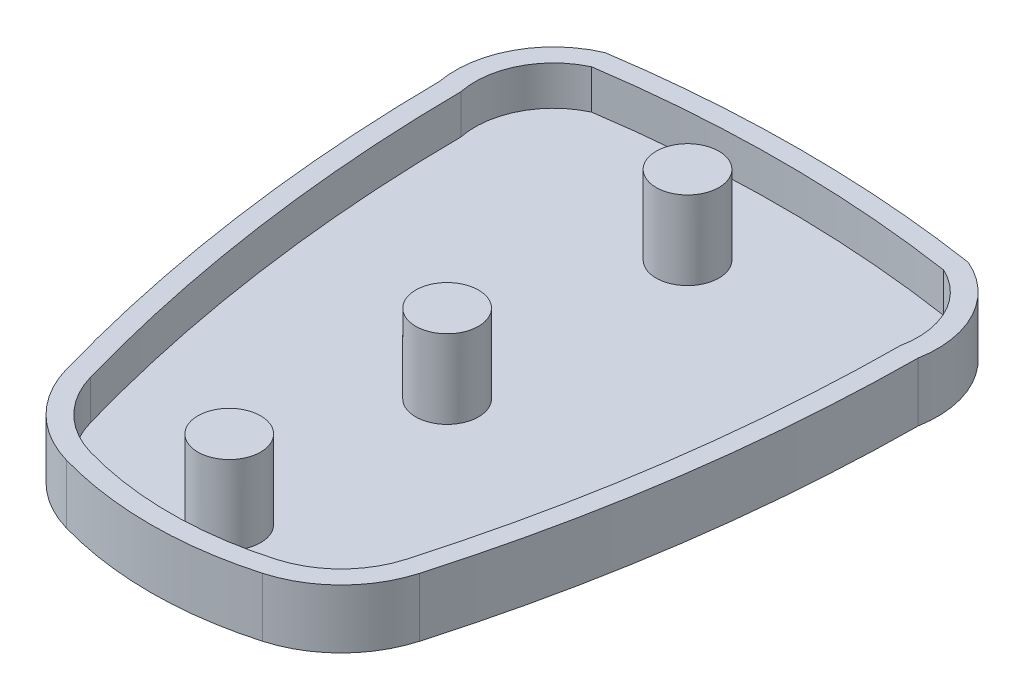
ISO-10303-21;
HEADER;
FILE_DESCRIPTION(('STEP AP214'),'2;1');
FILE_NAME('part.step','',(''),(''),'','','');
FILE_SCHEMA(('AUTOMOTIVE_DESIGN { 1 0 10303 214 1 1 1 1 }'));
ENDSEC;
DATA;
#1=APPLICATION_CONTEXT('core data for automotive mechanical design processes');
#2=APPLICATION_PROTOCOL_DEFINITION('international standard','automotive_design',2000,#1);
#3=PRODUCT_CONTEXT('',#1,'mechanical');
#4=PRODUCT('Part','Part','',(#3));
#5=PRODUCT_RELATED_PRODUCT_CATEGORY('part','',(#4));
#6=PRODUCT_DEFINITION_FORMATION('','',#4);
#7=PRODUCT_DEFINITION_CONTEXT('part definition',#1,'design');
#8=PRODUCT_DEFINITION('design','',#6,#7);
#9=PRODUCT_DEFINITION_SHAPE('','',#8);
#10=(LENGTH_UNIT() NAMED_UNIT(*) SI_UNIT(.MILLI.,.METRE.));
#11=(NAMED_UNIT(*) PLANE_ANGLE_UNIT() SI_UNIT($,.RADIAN.));
#12=(NAMED_UNIT(*) SI_UNIT($,.STERADIAN.) SOLID_ANGLE_UNIT());
#13=UNCERTAINTY_MEASURE_WITH_UNIT(LENGTH_MEASURE(1.E-05),#10,'distance_accuracy_value','');
#14=(GEOMETRIC_REPRESENTATION_CONTEXT(3) GLOBAL_UNCERTAINTY_ASSIGNED_CONTEXT((#13)) GLOBAL_UNIT_ASSIGNED_CONTEXT((#10,
#11,#12)) REPRESENTATION_CONTEXT('',''));
#15=CARTESIAN_POINT('',(0.,0.,0.));
#16=DIRECTION('',(0.,0.,1.));
#17=DIRECTION('',(1.,0.,0.));
#18=AXIS2_PLACEMENT_3D('',#15,#16,#17);
#19=CARTESIAN_POINT('',(31.909554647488,-1.,4.70987911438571));
#20=DIRECTION('',(0.,-1.,0.));
#21=DIRECTION('',(0.,0.,-1.));
#22=AXIS2_PLACEMENT_3D('',#19,#20,#21);
#23=PLANE('',#22);
#24=CARTESIAN_POINT('',(-4.10416305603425,-1.,15.8473088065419));
#25=DIRECTION('',(0.,-1.,0.));
#26=DIRECTION('',(0.,0.,-1.));
#27=AXIS2_PLACEMENT_3D('',#24,#25,#26);
#28=CIRCLE('',#27,0.599999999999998);
#29=CARTESIAN_POINT('',(-4.52842712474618,-1.,16.2715728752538));
#30=VERTEX_POINT('',#29);
#31=CARTESIAN_POINT('',(-3.67989898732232,-1.,15.42304473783));
#32=VERTEX_POINT('',#31);
#33=EDGE_CURVE('E563',#30,#32,#28,.T.);
#34=ORIENTED_EDGE('',*,*,#33,.F.);
#35=DIRECTION('',(-0.707106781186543,0.,-0.707106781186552));
#36=VECTOR('',#35,1.);
#37=CARTESIAN_POINT('',(-1.70000000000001,-1.,19.1));
#38=LINE('',#37,#36);
#39=CARTESIAN_POINT('',(-1.70000000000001,-1.,19.1));
#40=VERTEX_POINT('',#39);
#41=EDGE_CURVE('E623',#40,#30,#38,.T.);
#42=ORIENTED_EDGE('',*,*,#41,.F.);
#43=DIRECTION('',(-1.,0.,0.));
#44=VECTOR('',#43,1.);
#45=CARTESIAN_POINT('',(-1.70000000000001,-1.,19.1));
#46=LINE('',#45,#44);
#47=CARTESIAN_POINT('',(4.29999999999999,-1.,19.1));
#48=VERTEX_POINT('',#47);
#49=EDGE_CURVE('E649',#48,#40,#46,.T.);
#50=ORIENTED_EDGE('',*,*,#49,.F.);
#51=CARTESIAN_POINT('',(4.29999999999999,-1.,18.5));
#52=DIRECTION('',(0.,-1.,0.));
#53=DIRECTION('',(0.,0.,1.));
#54=AXIS2_PLACEMENT_3D('',#51,#52,#53);
#55=CIRCLE('',#54,0.6);
#56=CARTESIAN_POINT('',(4.29999999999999,-1.,17.9));
#57=VERTEX_POINT('',#56);
#58=EDGE_CURVE('E646',#57,#48,#55,.T.);
#59=ORIENTED_EDGE('',*,*,#58,.F.);
#60=DIRECTION('',(1.,0.,0.));
#61=VECTOR('',#60,1.);
#62=CARTESIAN_POINT('',(-1.20294372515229,-1.,17.9));
#63=LINE('',#62,#61);
#64=CARTESIAN_POINT('',(-1.20294372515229,-1.,17.9));
#65=VERTEX_POINT('',#64);
#66=EDGE_CURVE('E643',#65,#57,#63,.T.);
#67=ORIENTED_EDGE('',*,*,#66,.F.);
#68=DIRECTION('',(0.707106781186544,0.,0.707106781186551));
#69=VECTOR('',#68,1.);
#70=CARTESIAN_POINT('',(-1.20294372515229,-1.,17.9));
#71=LINE('',#70,#69);
#72=EDGE_CURVE('E640',#32,#65,#71,.T.);
#73=ORIENTED_EDGE('',*,*,#72,.F.);
#74=EDGE_LOOP('',(#34,#42,#50,#59,#67,#73));
#75=FACE_BOUND('',#74,.T.);
#76=DIRECTION('',(-1.,0.,0.));
#77=VECTOR('',#76,1.);
#78=CARTESIAN_POINT('',(11.0000000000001,-1.,11.775));
#79=LINE('',#78,#77);
#80=CARTESIAN_POINT('',(9.90500368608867,-1.,11.775));
#81=VERTEX_POINT('',#80);
#82=CARTESIAN_POINT('',(-9.90500368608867,-1.,11.775));
#83=VERTEX_POINT('',#82);
#84=EDGE_CURVE('E690',#81,#83,#79,.T.);
#85=ORIENTED_EDGE('',*,*,#84,.F.);
#86=CARTESIAN_POINT('',(-71.1014109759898,-1.,4.82322003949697));
#87=DIRECTION('',(0.,-1.,0.));
#88=DIRECTION('',(0.,0.,-1.));
#89=AXIS2_PLACEMENT_3D('',#86,#87,#88);
#90=CIRCLE('',#89,81.3041601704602);
#91=CARTESIAN_POINT('',(8.31315822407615,-1.,22.25));
#92=VERTEX_POINT('',#91);
#93=EDGE_CURVE('E453',#81,#92,#90,.T.);
#94=ORIENTED_EDGE('',*,*,#93,.T.);
#95=DIRECTION('',(1.,0.,0.));
#96=VECTOR('',#95,1.);
#97=CARTESIAN_POINT('',(8.49999999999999,-1.,22.25));
#98=LINE('',#97,#96);
#99=CARTESIAN_POINT('',(-8.31315822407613,-1.,22.25));
#100=VERTEX_POINT('',#99);
#101=EDGE_CURVE('E571',#100,#92,#98,.T.);
#102=ORIENTED_EDGE('',*,*,#101,.F.);
#103=CARTESIAN_POINT('',(71.1014109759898,-1.,4.82322003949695));
#104=DIRECTION('',(0.,-1.,0.));
#105=DIRECTION('',(0.,0.,-1.));
#106=AXIS2_PLACEMENT_3D('',#103,#104,#105);
#107=CIRCLE('',#106,81.3041601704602);
#108=EDGE_CURVE('E56',#100,#83,#107,.T.);
#109=ORIENTED_EDGE('',*,*,#108,.T.);
#110=EDGE_LOOP('',(#85,#94,#102,#109));
#111=FACE_BOUND('',#110,.T.);
#112=ADVANCED_FACE('F33',(#75,#111),#23,.T.);
#113=CARTESIAN_POINT('',(0.,-1.,6.05000000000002));
#114=DIRECTION('',(0.,-1.,0.));
#115=DIRECTION('',(0.,0.,-1.));
#116=AXIS2_PLACEMENT_3D('',#113,#114,#115);
#117=CIRCLE('',#116,3.2);
#118=CARTESIAN_POINT('',(0.,-1.,2.85000000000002));
#119=VERTEX_POINT('',#118);
#120=EDGE_CURVE('E610',#119,#119,#117,.T.);
#121=ORIENTED_EDGE('',*,*,#120,.F.);
#122=EDGE_LOOP('',(#121));
#123=FACE_BOUND('',#122,.T.);
#124=CARTESIAN_POINT('',(7.28230168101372,-1.,4.59653818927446));
#125=DIRECTION('',(0.,-1.,0.));
#126=DIRECTION('',(0.,0.,-1.));
#127=AXIS2_PLACEMENT_3D('',#124,#125,#126);
#128=CIRCLE('',#127,2.99999999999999);
#129=CARTESIAN_POINT('',(8.66636699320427,-1.,1.93489147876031));
#130=VERTEX_POINT('',#129);
#131=CARTESIAN_POINT('',(10.2014180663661,-1.,5.28846270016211));
#132=VERTEX_POINT('',#131);
#133=EDGE_CURVE('E448',#130,#132,#128,.T.);
#134=ORIENTED_EDGE('',*,*,#133,.T.);
#135=CARTESIAN_POINT('',(9.99904209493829,-1.,10.575));
#136=VERTEX_POINT('',#135);
#137=EDGE_CURVE('E417',#132,#136,#90,.T.);
#138=ORIENTED_EDGE('',*,*,#137,.T.);
#139=DIRECTION('',(1.,0.,0.));
#140=VECTOR('',#139,1.);
#141=CARTESIAN_POINT('',(11.0000000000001,-1.,10.575));
#142=LINE('',#141,#140);
#143=CARTESIAN_POINT('',(-9.99904209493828,-1.,10.575));
#144=VERTEX_POINT('',#143);
#145=EDGE_CURVE('E682',#144,#136,#142,.T.);
#146=ORIENTED_EDGE('',*,*,#145,.F.);
#147=CARTESIAN_POINT('',(-10.2014180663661,-1.,5.28846270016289));
#148=VERTEX_POINT('',#147);
#149=EDGE_CURVE('E48',#144,#148,#107,.T.);
#150=ORIENTED_EDGE('',*,*,#149,.T.);
#151=CARTESIAN_POINT('',(-7.28230168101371,-1.,4.59653818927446));
#152=DIRECTION('',(0.,-1.,0.));
#153=DIRECTION('',(0.,0.,-1.));
#154=AXIS2_PLACEMENT_3D('',#151,#152,#153);
#155=CIRCLE('',#154,3.00000000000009);
#156=CARTESIAN_POINT('',(-8.66636699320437,-1.,1.93489147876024));
#157=VERTEX_POINT('',#156);
#158=EDGE_CURVE('E442',#148,#157,#155,.T.);
#159=ORIENTED_EDGE('',*,*,#158,.T.);
#160=CARTESIAN_POINT('',(0.,-1.,60.7660714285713));
#161=DIRECTION('',(0.,-1.,0.));
#162=DIRECTION('',(0.,0.,-1.));
#163=AXIS2_PLACEMENT_3D('',#160,#161,#162);
#164=CIRCLE('',#163,59.4660714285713);
#165=EDGE_CURVE('E445',#157,#130,#164,.T.);
#166=ORIENTED_EDGE('',*,*,#165,.T.);
#167=EDGE_LOOP('',(#134,#138,#146,#150,#159,#166));
#168=FACE_BOUND('',#167,.T.);
#169=ADVANCED_FACE('F884',(#123,#168),#23,.T.);
#170=CARTESIAN_POINT('',(1.83847763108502,-1.,24.561522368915));
#171=DIRECTION('',(0.,-1.,0.));
#172=DIRECTION('',(0.,0.,1.));
#173=AXIS2_PLACEMENT_3D('',#170,#171,#172);
#174=CIRCLE('',#173,0.6);
#175=CARTESIAN_POINT('',(1.41421356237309,-1.,24.9857864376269));
#176=VERTEX_POINT('',#175);
#177=CARTESIAN_POINT('',(2.26274169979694,-1.,24.1372583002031));
#178=VERTEX_POINT('',#177);
#179=EDGE_CURVE('E589',#176,#178,#174,.T.);
#180=ORIENTED_EDGE('',*,*,#179,.F.);
#181=CARTESIAN_POINT('',(0.,-1.,26.4));
#182=DIRECTION('',(0.,1.,0.));
#183=DIRECTION('',(0.,0.,-1.));
#184=AXIS2_PLACEMENT_3D('',#181,#182,#183);
#185=CIRCLE('',#184,2.);
#186=CARTESIAN_POINT('',(-1.41421356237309,-1.,24.9857864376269));
#187=VERTEX_POINT('',#186);
#188=EDGE_CURVE('E581',#187,#176,#185,.T.);
#189=ORIENTED_EDGE('',*,*,#188,.F.);
#190=CARTESIAN_POINT('',(-1.83847763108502,-1.,24.561522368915));
#191=DIRECTION('',(0.,-1.,0.));
#192=DIRECTION('',(0.,0.,-1.));
#193=AXIS2_PLACEMENT_3D('',#190,#191,#192);
#194=CIRCLE('',#193,0.600000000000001);
#195=CARTESIAN_POINT('',(-2.26274169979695,-1.,24.1372583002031));
#196=VERTEX_POINT('',#195);
#197=EDGE_CURVE('E595',#196,#187,#194,.T.);
#198=ORIENTED_EDGE('',*,*,#197,.F.);
#199=CARTESIAN_POINT('',(0.,-1.,26.4));
#200=DIRECTION('',(0.,-1.,0.));
#201=DIRECTION('',(0.,0.,1.));
#202=AXIS2_PLACEMENT_3D('',#199,#200,#201);
#203=CIRCLE('',#202,3.2);
#204=EDGE_CURVE('E591',#178,#196,#203,.T.);
#205=ORIENTED_EDGE('',*,*,#204,.F.);
#206=EDGE_LOOP('',(#180,#189,#198,#205));
#207=FACE_BOUND('',#206,.T.);
#208=DIRECTION('',(-1.,0.,0.));
#209=VECTOR('',#208,1.);
#210=CARTESIAN_POINT('',(8.49999999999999,-1.,23.45));
#211=LINE('',#210,#209);
#212=CARTESIAN_POINT('',(8.0402943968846,-1.,23.45));
#213=VERTEX_POINT('',#212);
#214=CARTESIAN_POINT('',(-8.04029439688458,-1.,23.45));
#215=VERTEX_POINT('',#214);
#216=EDGE_CURVE('E568',#213,#215,#211,.T.);
#217=ORIENTED_EDGE('',*,*,#216,.F.);
#218=CARTESIAN_POINT('',(7.07689289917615,-1.,27.1507650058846));
#219=VERTEX_POINT('',#218);
#220=EDGE_CURVE('E451',#213,#219,#90,.T.);
#221=ORIENTED_EDGE('',*,*,#220,.T.);
#222=CARTESIAN_POINT('',(3.40091376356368,-1.,26.1009137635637));
#223=DIRECTION('',(0.,-1.,0.));
#224=DIRECTION('',(0.,0.,-1.));
#225=AXIS2_PLACEMENT_3D('',#222,#223,#224);
#226=CIRCLE('',#225,3.8229583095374);
#227=CARTESIAN_POINT('',(4.45076500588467,-1.,29.7768928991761));
#228=VERTEX_POINT('',#227);
#229=EDGE_CURVE('E414',#219,#228,#226,.T.);
#230=ORIENTED_EDGE('',*,*,#229,.T.);
#231=CARTESIAN_POINT('',(0.,-1.,14.1928571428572));
#232=DIRECTION('',(0.,-1.,0.));
#233=DIRECTION('',(0.,0.,-1.));
#234=AXIS2_PLACEMENT_3D('',#231,#232,#233);
#235=CIRCLE('',#234,16.2071428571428);
#236=CARTESIAN_POINT('',(-4.45076500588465,-1.,29.7768928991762));
#237=VERTEX_POINT('',#236);
#238=EDGE_CURVE('E436',#228,#237,#235,.T.);
#239=ORIENTED_EDGE('',*,*,#238,.T.);
#240=CARTESIAN_POINT('',(-3.40091376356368,-1.,26.1009137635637));
#241=DIRECTION('',(0.,-1.,0.));
#242=DIRECTION('',(0.,0.,-1.));
#243=AXIS2_PLACEMENT_3D('',#240,#241,#242);
#244=CIRCLE('',#243,3.8229583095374);
#245=CARTESIAN_POINT('',(-7.07689289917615,-1.,27.1507650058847));
#246=VERTEX_POINT('',#245);
#247=EDGE_CURVE('E391',#237,#246,#244,.T.);
#248=ORIENTED_EDGE('',*,*,#247,.T.);
#249=EDGE_CURVE('E439',#246,#215,#107,.T.);
#250=ORIENTED_EDGE('',*,*,#249,.T.);
#251=EDGE_LOOP('',(#217,#221,#230,#239,#248,#250));
#252=FACE_BOUND('',#251,.T.);
#253=ADVANCED_FACE('F890',(#207,#252),#23,.T.);
#254=CARTESIAN_POINT('',(11.0000000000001,-0.5,11.775));
#255=DIRECTION('',(0.,0.,1.));
#256=DIRECTION('',(1.,0.,0.));
#257=AXIS2_PLACEMENT_3D('',#254,#255,#256);
#258=PLANE('',#257);
#259=DIRECTION('',(0.,-1.,0.));
#260=VECTOR('',#259,1.);
#261=CARTESIAN_POINT('',(9.90500368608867,-0.5,11.775));
#262=LINE('',#261,#260);
#263=CARTESIAN_POINT('',(9.90500368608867,-0.5,11.775));
#264=VERTEX_POINT('',#263);
#265=EDGE_CURVE('E549',#81,#264,#262,.F.);
#266=ORIENTED_EDGE('',*,*,#265,.F.);
#267=ORIENTED_EDGE('',*,*,#84,.T.);
#268=DIRECTION('',(0.,-1.,0.));
#269=VECTOR('',#268,1.);
#270=CARTESIAN_POINT('',(-9.90500368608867,-0.5,11.775));
#271=LINE('',#270,#269);
#272=CARTESIAN_POINT('',(-9.90500368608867,-0.5,11.775));
#273=VERTEX_POINT('',#272);
#274=EDGE_CURVE('E541',#273,#83,#271,.T.);
#275=ORIENTED_EDGE('',*,*,#274,.F.);
#276=DIRECTION('',(-1.,0.,0.));
#277=VECTOR('',#276,1.);
#278=CARTESIAN_POINT('',(11.0000000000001,-0.5,11.775));
#279=LINE('',#278,#277);
#280=EDGE_CURVE('E679',#264,#273,#279,.T.);
#281=ORIENTED_EDGE('',*,*,#280,.F.);
#282=EDGE_LOOP('',(#266,#267,#275,#281));
#283=FACE_BOUND('',#282,.T.);
#284=ADVANCED_FACE('F922',(#283),#258,.F.);
#285=CARTESIAN_POINT('',(11.0000000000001,-1.,11.775));
#286=VERTEX_POINT('',#285);
#287=CARTESIAN_POINT('',(10.9086343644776,-1.,11.775));
#288=VERTEX_POINT('',#287);
#289=EDGE_CURVE('E669',#286,#288,#79,.T.);
#290=ORIENTED_EDGE('',*,*,#289,.T.);
#291=DIRECTION('',(0.,-1.,0.));
#292=VECTOR('',#291,1.);
#293=CARTESIAN_POINT('',(10.9086343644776,-0.5,11.775));
#294=LINE('',#293,#292);
#295=CARTESIAN_POINT('',(10.9086343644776,-0.5,11.775));
#296=VERTEX_POINT('',#295);
#297=EDGE_CURVE('E554',#288,#296,#294,.F.);
#298=ORIENTED_EDGE('',*,*,#297,.T.);
#299=CARTESIAN_POINT('',(11.0000000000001,-0.5,11.775));
#300=VERTEX_POINT('',#299);
#301=EDGE_CURVE('E675',#300,#296,#279,.T.);
#302=ORIENTED_EDGE('',*,*,#301,.F.);
#303=DIRECTION('',(0.,-1.,0.));
#304=VECTOR('',#303,1.);
#305=CARTESIAN_POINT('',(11.0000000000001,-0.5,11.775));
#306=LINE('',#305,#304);
#307=EDGE_CURVE('E678',#300,#286,#306,.T.);
#308=ORIENTED_EDGE('',*,*,#307,.T.);
#309=EDGE_LOOP('',(#290,#298,#302,#308));
#310=FACE_BOUND('',#309,.T.);
#311=ADVANCED_FACE('F927',(#310),#258,.F.);
#312=CARTESIAN_POINT('',(11.0000000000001,-0.5,10.575));
#313=DIRECTION('',(0.,0.,-1.));
#314=DIRECTION('',(-1.,0.,0.));
#315=AXIS2_PLACEMENT_3D('',#312,#313,#314);
#316=PLANE('',#315);
#317=DIRECTION('',(0.,-1.,0.));
#318=VECTOR('',#317,1.);
#319=CARTESIAN_POINT('',(9.99904209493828,-0.5,10.575));
#320=LINE('',#319,#318);
#321=CARTESIAN_POINT('',(9.99904209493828,-0.5,10.575));
#322=VERTEX_POINT('',#321);
#323=EDGE_CURVE('E547',#322,#136,#320,.T.);
#324=ORIENTED_EDGE('',*,*,#323,.F.);
#325=DIRECTION('',(1.,0.,0.));
#326=VECTOR('',#325,1.);
#327=CARTESIAN_POINT('',(11.0000000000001,-0.5,10.575));
#328=LINE('',#327,#326);
#329=CARTESIAN_POINT('',(-9.99904209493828,-0.5,10.575));
#330=VERTEX_POINT('',#329);
#331=EDGE_CURVE('E668',#330,#322,#328,.T.);
#332=ORIENTED_EDGE('',*,*,#331,.F.);
#333=DIRECTION('',(0.,-1.,0.));
#334=VECTOR('',#333,1.);
#335=CARTESIAN_POINT('',(-9.99904209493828,-0.5,10.575));
#336=LINE('',#335,#334);
#337=EDGE_CURVE('E539',#144,#330,#336,.F.);
#338=ORIENTED_EDGE('',*,*,#337,.F.);
#339=ORIENTED_EDGE('',*,*,#145,.T.);
#340=EDGE_LOOP('',(#324,#332,#338,#339));
#341=FACE_BOUND('',#340,.T.);
#342=ADVANCED_FACE('F1051',(#341),#316,.F.);
#343=CARTESIAN_POINT('',(8.49999999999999,-0.5,23.45));
#344=DIRECTION('',(0.,0.,1.));
#345=DIRECTION('',(1.,0.,0.));
#346=AXIS2_PLACEMENT_3D('',#343,#344,#345);
#347=PLANE('',#346);
#348=DIRECTION('',(0.,-1.,0.));
#349=VECTOR('',#348,1.);
#350=CARTESIAN_POINT('',(8.04029439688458,-0.5,23.45));
#351=LINE('',#350,#349);
#352=CARTESIAN_POINT('',(8.04029439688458,-0.5,23.45));
#353=VERTEX_POINT('',#352);
#354=EDGE_CURVE('E545',#213,#353,#351,.F.);
#355=ORIENTED_EDGE('',*,*,#354,.F.);
#356=ORIENTED_EDGE('',*,*,#216,.T.);
#357=DIRECTION('',(0.,-1.,0.));
#358=VECTOR('',#357,1.);
#359=CARTESIAN_POINT('',(-8.04029439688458,-0.5,23.45));
#360=LINE('',#359,#358);
#361=CARTESIAN_POINT('',(-8.04029439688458,-0.5,23.45));
#362=VERTEX_POINT('',#361);
#363=EDGE_CURVE('E537',#362,#215,#360,.T.);
#364=ORIENTED_EDGE('',*,*,#363,.F.);
#365=DIRECTION('',(-1.,0.,0.));
#366=VECTOR('',#365,1.);
#367=CARTESIAN_POINT('',(8.49999999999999,-0.5,23.45));
#368=LINE('',#367,#366);
#369=EDGE_CURVE('E567',#353,#362,#368,.T.);
#370=ORIENTED_EDGE('',*,*,#369,.F.);
#371=EDGE_LOOP('',(#355,#356,#364,#370));
#372=FACE_BOUND('',#371,.T.);
#373=ADVANCED_FACE('F941',(#372),#347,.F.);
#374=CARTESIAN_POINT('',(8.49999999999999,-0.5,22.25));
#375=DIRECTION('',(0.,0.,-1.));
#376=DIRECTION('',(-1.,0.,0.));
#377=AXIS2_PLACEMENT_3D('',#374,#375,#376);
#378=PLANE('',#377);
#379=DIRECTION('',(0.,-1.,0.));
#380=VECTOR('',#379,1.);
#381=CARTESIAN_POINT('',(8.31315822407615,-0.5,22.25));
#382=LINE('',#381,#380);
#383=CARTESIAN_POINT('',(8.31315822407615,-0.5,22.25));
#384=VERTEX_POINT('',#383);
#385=EDGE_CURVE('E543',#384,#92,#382,.T.);
#386=ORIENTED_EDGE('',*,*,#385,.F.);
#387=DIRECTION('',(1.,0.,0.));
#388=VECTOR('',#387,1.);
#389=CARTESIAN_POINT('',(8.49999999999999,-0.5,22.25));
#390=LINE('',#389,#388);
#391=CARTESIAN_POINT('',(-8.31315822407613,-0.5,22.25));
#392=VERTEX_POINT('',#391);
#393=EDGE_CURVE('E564',#392,#384,#390,.T.);
#394=ORIENTED_EDGE('',*,*,#393,.F.);
#395=DIRECTION('',(0.,-1.,0.));
#396=VECTOR('',#395,1.);
#397=CARTESIAN_POINT('',(-8.31315822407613,-0.5,22.25));
#398=LINE('',#397,#396);
#399=EDGE_CURVE('E520',#100,#392,#398,.F.);
#400=ORIENTED_EDGE('',*,*,#399,.F.);
#401=ORIENTED_EDGE('',*,*,#101,.T.);
#402=EDGE_LOOP('',(#386,#394,#400,#401));
#403=FACE_BOUND('',#402,.T.);
#404=ADVANCED_FACE('F956',(#403),#378,.F.);
#405=CARTESIAN_POINT('',(3.64115084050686,2.,32.6813048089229));
#406=DIRECTION('',(0.,-1.,0.));
#407=DIRECTION('',(0.,0.,-1.));
#408=AXIS2_PLACEMENT_3D('',#405,#406,#407);
#409=PLANE('',#408);
#410=CARTESIAN_POINT('',(0.,2.,60.7660714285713));
#411=DIRECTION('',(0.,1.,0.));
#412=DIRECTION('',(0.,0.,-1.));
#413=AXIS2_PLACEMENT_3D('',#410,#411,#412);
#414=CIRCLE('',#413,61.4660714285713);
#415=CARTESIAN_POINT('',(9.25,2.,0.));
#416=VERTEX_POINT('',#415);
#417=CARTESIAN_POINT('',(-9.25,2.,0.));
#418=VERTEX_POINT('',#417);
#419=EDGE_CURVE('E789',#416,#418,#414,.T.);
#420=ORIENTED_EDGE('',*,*,#419,.T.);
#421=CARTESIAN_POINT('',(-7.28230168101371,2.,4.59653818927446));
#422=DIRECTION('',(0.,1.,0.));
#423=DIRECTION('',(0.,0.,-1.));
#424=AXIS2_PLACEMENT_3D('',#421,#422,#423);
#425=CIRCLE('',#424,5.);
#426=CARTESIAN_POINT('',(-12.2,2.,5.50000000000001));
#427=VERTEX_POINT('',#426);
#428=EDGE_CURVE('E792',#418,#427,#425,.T.);
#429=ORIENTED_EDGE('',*,*,#428,.T.);
#430=CARTESIAN_POINT('',(71.1014109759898,2.,4.82322003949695));
#431=DIRECTION('',(0.,1.,0.));
#432=DIRECTION('',(0.,0.,1.));
#433=AXIS2_PLACEMENT_3D('',#430,#431,#432);
#434=CIRCLE('',#433,83.3041601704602);
#435=CARTESIAN_POINT('',(-8.99999999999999,2.,27.7));
#436=VERTEX_POINT('',#435);
#437=EDGE_CURVE('E794',#427,#436,#434,.T.);
#438=ORIENTED_EDGE('',*,*,#437,.T.);
#439=CARTESIAN_POINT('',(-3.40091376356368,2.,26.1009137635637));
#440=DIRECTION('',(0.,1.,0.));
#441=DIRECTION('',(0.,0.,-1.));
#442=AXIS2_PLACEMENT_3D('',#439,#440,#441);
#443=CIRCLE('',#442,5.82295830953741);
#444=CARTESIAN_POINT('',(-5.,2.,31.7));
#445=VERTEX_POINT('',#444);
#446=EDGE_CURVE('E796',#436,#445,#443,.T.);
#447=ORIENTED_EDGE('',*,*,#446,.T.);
#448=CARTESIAN_POINT('',(0.,2.,14.1928571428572));
#449=DIRECTION('',(0.,1.,0.));
#450=DIRECTION('',(0.,0.,1.));
#451=AXIS2_PLACEMENT_3D('',#448,#449,#450);
#452=CIRCLE('',#451,18.2071428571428);
#453=CARTESIAN_POINT('',(5.00000000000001,2.,31.7));
#454=VERTEX_POINT('',#453);
#455=EDGE_CURVE('E798',#445,#454,#452,.T.);
#456=ORIENTED_EDGE('',*,*,#455,.T.);
#457=CARTESIAN_POINT('',(3.40091376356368,2.,26.1009137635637));
#458=DIRECTION('',(0.,1.,0.));
#459=DIRECTION('',(0.,0.,1.));
#460=AXIS2_PLACEMENT_3D('',#457,#458,#459);
#461=CIRCLE('',#460,5.8229583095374);
#462=CARTESIAN_POINT('',(9.,2.,27.7));
#463=VERTEX_POINT('',#462);
#464=EDGE_CURVE('E800',#454,#463,#461,.T.);
#465=ORIENTED_EDGE('',*,*,#464,.T.);
#466=CARTESIAN_POINT('',(-71.1014109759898,2.,4.82322003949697));
#467=DIRECTION('',(0.,1.,0.));
#468=DIRECTION('',(0.,0.,-1.));
#469=AXIS2_PLACEMENT_3D('',#466,#467,#468);
#470=CIRCLE('',#469,83.3041601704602);
#471=CARTESIAN_POINT('',(12.2,2.,5.50000000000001));
#472=VERTEX_POINT('',#471);
#473=EDGE_CURVE('E802',#463,#472,#470,.T.);
#474=ORIENTED_EDGE('',*,*,#473,.T.);
#475=CARTESIAN_POINT('',(7.28230168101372,2.,4.59653818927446));
#476=DIRECTION('',(0.,1.,0.));
#477=DIRECTION('',(0.,0.,1.));
#478=AXIS2_PLACEMENT_3D('',#475,#476,#477);
#479=CIRCLE('',#478,5.);
#480=EDGE_CURVE('E804',#472,#416,#479,.T.);
#481=ORIENTED_EDGE('',*,*,#480,.T.);
#482=EDGE_LOOP('',(#420,#429,#438,#447,#456,#465,#474,#481));
#483=FACE_BOUND('',#482,.T.);
#484=CARTESIAN_POINT('',(71.1014109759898,2.,4.82322003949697));
#485=DIRECTION('',(0.,1.,0.));
#486=DIRECTION('',(0.,0.,1.));
#487=AXIS2_PLACEMENT_3D('',#484,#485,#486);
#488=CIRCLE('',#487,82.3041601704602);
#489=CARTESIAN_POINT('',(-11.2007264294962,2.,5.4002467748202));
#490=VERTEX_POINT('',#489);
#491=CARTESIAN_POINT('',(-8.03844644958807,2.,27.4253825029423));
#492=VERTEX_POINT('',#491);
#493=EDGE_CURVE('E730',#490,#492,#488,.T.);
#494=ORIENTED_EDGE('',*,*,#493,.F.);
#495=CARTESIAN_POINT('',(-7.28230168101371,2.,4.59653818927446));
#496=DIRECTION('',(0.,1.,0.));
#497=DIRECTION('',(0.,0.,-1.));
#498=AXIS2_PLACEMENT_3D('',#495,#496,#497);
#499=CIRCLE('',#498,4.00000000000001);
#500=CARTESIAN_POINT('',(-8.96690723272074,2.,0.968576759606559));
#501=VERTEX_POINT('',#500);
#502=EDGE_CURVE('E746',#501,#490,#499,.T.);
#503=ORIENTED_EDGE('',*,*,#502,.F.);
#504=CARTESIAN_POINT('',(0.,2.,60.7660714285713));
#505=DIRECTION('',(0.,1.,0.));
#506=DIRECTION('',(0.,0.,-1.));
#507=AXIS2_PLACEMENT_3D('',#504,#505,#506);
#508=CIRCLE('',#507,60.4660714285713);
#509=CARTESIAN_POINT('',(8.96690723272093,2.,0.968576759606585));
#510=VERTEX_POINT('',#509);
#511=EDGE_CURVE('E743',#510,#501,#508,.T.);
#512=ORIENTED_EDGE('',*,*,#511,.F.);
#513=CARTESIAN_POINT('',(7.28230168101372,2.,4.59653818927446));
#514=DIRECTION('',(0.,1.,0.));
#515=DIRECTION('',(0.,0.,1.));
#516=AXIS2_PLACEMENT_3D('',#513,#514,#515);
#517=CIRCLE('',#516,4.00000000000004);
#518=CARTESIAN_POINT('',(11.2007264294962,2.,5.40024677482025));
#519=VERTEX_POINT('',#518);
#520=EDGE_CURVE('E741',#519,#510,#517,.T.);
#521=ORIENTED_EDGE('',*,*,#520,.F.);
#522=CARTESIAN_POINT('',(-71.1014109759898,2.,4.82322003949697));
#523=DIRECTION('',(0.,1.,0.));
#524=DIRECTION('',(0.,0.,-1.));
#525=AXIS2_PLACEMENT_3D('',#522,#523,#524);
#526=CIRCLE('',#525,82.3041601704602);
#527=CARTESIAN_POINT('',(8.03844644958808,2.,27.4253825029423));
#528=VERTEX_POINT('',#527);
#529=EDGE_CURVE('E739',#528,#519,#526,.T.);
#530=ORIENTED_EDGE('',*,*,#529,.F.);
#531=CARTESIAN_POINT('',(3.40091376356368,2.,26.1009137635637));
#532=DIRECTION('',(0.,1.,0.));
#533=DIRECTION('',(0.,0.,1.));
#534=AXIS2_PLACEMENT_3D('',#531,#532,#533);
#535=CIRCLE('',#534,4.8229583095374);
#536=CARTESIAN_POINT('',(4.72538250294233,2.,30.7384464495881));
#537=VERTEX_POINT('',#536);
#538=EDGE_CURVE('E737',#537,#528,#535,.T.);
#539=ORIENTED_EDGE('',*,*,#538,.F.);
#540=CARTESIAN_POINT('',(0.,2.,14.1928571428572));
#541=DIRECTION('',(0.,1.,0.));
#542=DIRECTION('',(0.,0.,1.));
#543=AXIS2_PLACEMENT_3D('',#540,#541,#542);
#544=CIRCLE('',#543,17.2071428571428);
#545=CARTESIAN_POINT('',(-4.72538250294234,2.,30.7384464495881));
#546=VERTEX_POINT('',#545);
#547=EDGE_CURVE('E735',#546,#537,#544,.T.);
#548=ORIENTED_EDGE('',*,*,#547,.F.);
#549=CARTESIAN_POINT('',(-3.40091376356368,2.,26.1009137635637));
#550=DIRECTION('',(0.,1.,0.));
#551=DIRECTION('',(0.,0.,-1.));
#552=AXIS2_PLACEMENT_3D('',#549,#550,#551);
#553=CIRCLE('',#552,4.82295830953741);
#554=EDGE_CURVE('E732',#492,#546,#553,.T.);
#555=ORIENTED_EDGE('',*,*,#554,.F.);
#556=EDGE_LOOP('',(#494,#503,#512,#521,#530,#539,#548,#555));
#557=FACE_BOUND('',#556,.T.);
#558=ADVANCED_FACE('F853',(#483,#557),#409,.F.);
#559=CARTESIAN_POINT('',(0.,2.,60.7660714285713));
#560=DIRECTION('',(0.,-1.,0.));
#561=DIRECTION('',(0.,0.,-1.));
#562=AXIS2_PLACEMENT_3D('',#559,#560,#561);
#563=CYLINDRICAL_SURFACE('',#562,61.4660714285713);
#564=DIRECTION('',(0.,-1.,0.));
#565=VECTOR('',#564,1.);
#566=CARTESIAN_POINT('',(9.25,2.,0.));
#567=LINE('',#566,#565);
#568=CARTESIAN_POINT('',(9.24999999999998,-1.,0.));
#569=VERTEX_POINT('',#568);
#570=EDGE_CURVE('E806',#416,#569,#567,.T.);
#571=ORIENTED_EDGE('',*,*,#570,.T.);
#572=CARTESIAN_POINT('',(0.,-1.,60.7660714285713));
#573=DIRECTION('',(0.,-1.,0.));
#574=DIRECTION('',(0.,0.,-1.));
#575=AXIS2_PLACEMENT_3D('',#572,#573,#574);
#576=CIRCLE('',#575,61.4660714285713);
#577=CARTESIAN_POINT('',(-9.25,-1.,0.));
#578=VERTEX_POINT('',#577);
#579=EDGE_CURVE('E711',#578,#569,#576,.T.);
#580=ORIENTED_EDGE('',*,*,#579,.F.);
#581=DIRECTION('',(0.,-1.,0.));
#582=VECTOR('',#581,1.);
#583=CARTESIAN_POINT('',(-9.25,2.,0.));
#584=LINE('',#583,#582);
#585=EDGE_CURVE('E820',#418,#578,#584,.T.);
#586=ORIENTED_EDGE('',*,*,#585,.F.);
#587=ORIENTED_EDGE('',*,*,#419,.F.);
#588=EDGE_LOOP('',(#571,#580,#586,#587));
#589=FACE_BOUND('',#588,.T.);
#590=ADVANCED_FACE('F35',(#589),#563,.T.);
#591=CARTESIAN_POINT('',(-7.28230168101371,2.,4.59653818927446));
#592=DIRECTION('',(0.,-1.,0.));
#593=DIRECTION('',(0.,0.,-1.));
#594=AXIS2_PLACEMENT_3D('',#591,#592,#593);
#595=CYLINDRICAL_SURFACE('',#594,5.);
#596=ORIENTED_EDGE('',*,*,#585,.T.);
#597=CARTESIAN_POINT('',(-7.28230168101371,-1.,4.59653818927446));
#598=DIRECTION('',(0.,-1.,0.));
#599=DIRECTION('',(0.,0.,-1.));
#600=AXIS2_PLACEMENT_3D('',#597,#598,#599);
#601=CIRCLE('',#600,4.99999999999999);
#602=CARTESIAN_POINT('',(-12.2,-1.,5.50000000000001));
#603=VERTEX_POINT('',#602);
#604=EDGE_CURVE('E708',#603,#578,#601,.T.);
#605=ORIENTED_EDGE('',*,*,#604,.F.);
#606=DIRECTION('',(0.,-1.,0.));
#607=VECTOR('',#606,1.);
#608=CARTESIAN_POINT('',(-12.2,2.,5.50000000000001));
#609=LINE('',#608,#607);
#610=EDGE_CURVE('E818',#427,#603,#609,.T.);
#611=ORIENTED_EDGE('',*,*,#610,.F.);
#612=ORIENTED_EDGE('',*,*,#428,.F.);
#613=EDGE_LOOP('',(#596,#605,#611,#612));
#614=FACE_BOUND('',#613,.T.);
#615=ADVANCED_FACE('F1429',(#614),#595,.T.);
#616=CARTESIAN_POINT('',(71.1014109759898,2.,4.82322003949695));
#617=DIRECTION('',(0.,-1.,0.));
#618=DIRECTION('',(0.,0.,-1.));
#619=AXIS2_PLACEMENT_3D('',#616,#617,#618);
#620=CYLINDRICAL_SURFACE('',#619,83.3041601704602);
#621=ORIENTED_EDGE('',*,*,#610,.T.);
#622=CARTESIAN_POINT('',(71.1014109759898,-1.,4.82322003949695));
#623=DIRECTION('',(0.,-1.,0.));
#624=DIRECTION('',(0.,0.,-1.));
#625=AXIS2_PLACEMENT_3D('',#622,#623,#624);
#626=CIRCLE('',#625,83.3041601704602);
#627=CARTESIAN_POINT('',(-9.,-1.,27.7));
#628=VERTEX_POINT('',#627);
#629=EDGE_CURVE('E705',#628,#603,#626,.T.);
#630=ORIENTED_EDGE('',*,*,#629,.F.);
#631=DIRECTION('',(0.,-1.,0.));
#632=VECTOR('',#631,1.);
#633=CARTESIAN_POINT('',(-8.99999999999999,2.,27.7));
#634=LINE('',#633,#632);
#635=EDGE_CURVE('E816',#436,#628,#634,.T.);
#636=ORIENTED_EDGE('',*,*,#635,.F.);
#637=ORIENTED_EDGE('',*,*,#437,.F.);
#638=EDGE_LOOP('',(#621,#630,#636,#637));
#639=FACE_BOUND('',#638,.T.);
#640=ADVANCED_FACE('F1418',(#639),#620,.T.);
#641=CARTESIAN_POINT('',(-3.40091376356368,2.,26.1009137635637));
#642=DIRECTION('',(0.,-1.,0.));
#643=DIRECTION('',(0.,0.,-1.));
#644=AXIS2_PLACEMENT_3D('',#641,#642,#643);
#645=CYLINDRICAL_SURFACE('',#644,5.82295830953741);
#646=ORIENTED_EDGE('',*,*,#635,.T.);
#647=CARTESIAN_POINT('',(-3.40091376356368,-1.,26.1009137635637));
#648=DIRECTION('',(0.,-1.,0.));
#649=DIRECTION('',(0.,0.,-1.));
#650=AXIS2_PLACEMENT_3D('',#647,#648,#649);
#651=CIRCLE('',#650,5.8229583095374);
#652=CARTESIAN_POINT('',(-4.99999999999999,-1.,31.7));
#653=VERTEX_POINT('',#652);
#654=EDGE_CURVE('E726',#653,#628,#651,.T.);
#655=ORIENTED_EDGE('',*,*,#654,.F.);
#656=DIRECTION('',(0.,-1.,0.));
#657=VECTOR('',#656,1.);
#658=CARTESIAN_POINT('',(-5.,2.,31.7));
#659=LINE('',#658,#657);
#660=EDGE_CURVE('E814',#445,#653,#659,.T.);
#661=ORIENTED_EDGE('',*,*,#660,.F.);
#662=ORIENTED_EDGE('',*,*,#446,.F.);
#663=EDGE_LOOP('',(#646,#655,#661,#662));
#664=FACE_BOUND('',#663,.T.);
#665=ADVANCED_FACE('F1407',(#664),#645,.T.);
#666=CARTESIAN_POINT('',(0.,2.,14.1928571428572));
#667=DIRECTION('',(0.,-1.,0.));
#668=DIRECTION('',(0.,0.,-1.));
#669=AXIS2_PLACEMENT_3D('',#666,#667,#668);
#670=CYLINDRICAL_SURFACE('',#669,18.2071428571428);
#671=ORIENTED_EDGE('',*,*,#660,.T.);
#672=CARTESIAN_POINT('',(0.,-1.,14.1928571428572));
#673=DIRECTION('',(0.,-1.,0.));
#674=DIRECTION('',(0.,0.,-1.));
#675=AXIS2_PLACEMENT_3D('',#672,#673,#674);
#676=CIRCLE('',#675,18.2071428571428);
#677=CARTESIAN_POINT('',(5.00000000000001,-1.,31.7));
#678=VERTEX_POINT('',#677);
#679=EDGE_CURVE('E723',#678,#653,#676,.T.);
#680=ORIENTED_EDGE('',*,*,#679,.F.);
#681=DIRECTION('',(0.,-1.,0.));
#682=VECTOR('',#681,1.);
#683=CARTESIAN_POINT('',(5.00000000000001,2.,31.7));
#684=LINE('',#683,#682);
#685=EDGE_CURVE('E812',#454,#678,#684,.T.);
#686=ORIENTED_EDGE('',*,*,#685,.F.);
#687=ORIENTED_EDGE('',*,*,#455,.F.);
#688=EDGE_LOOP('',(#671,#680,#686,#687));
#689=FACE_BOUND('',#688,.T.);
#690=ADVANCED_FACE('F1396',(#689),#670,.T.);
#691=CARTESIAN_POINT('',(3.40091376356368,2.,26.1009137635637));
#692=DIRECTION('',(0.,-1.,0.));
#693=DIRECTION('',(0.,0.,-1.));
#694=AXIS2_PLACEMENT_3D('',#691,#692,#693);
#695=CYLINDRICAL_SURFACE('',#694,5.8229583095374);
#696=ORIENTED_EDGE('',*,*,#685,.T.);
#697=CARTESIAN_POINT('',(3.40091376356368,-1.,26.1009137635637));
#698=DIRECTION('',(0.,-1.,0.));
#699=DIRECTION('',(0.,0.,-1.));
#700=AXIS2_PLACEMENT_3D('',#697,#698,#699);
#701=CIRCLE('',#700,5.8229583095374);
#702=CARTESIAN_POINT('',(9.00000000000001,-1.,27.7));
#703=VERTEX_POINT('',#702);
#704=EDGE_CURVE('E720',#703,#678,#701,.T.);
#705=ORIENTED_EDGE('',*,*,#704,.F.);
#706=DIRECTION('',(0.,-1.,0.));
#707=VECTOR('',#706,1.);
#708=CARTESIAN_POINT('',(9.,2.,27.7));
#709=LINE('',#708,#707);
#710=EDGE_CURVE('E810',#463,#703,#709,.T.);
#711=ORIENTED_EDGE('',*,*,#710,.F.);
#712=ORIENTED_EDGE('',*,*,#464,.F.);
#713=EDGE_LOOP('',(#696,#705,#711,#712));
#714=FACE_BOUND('',#713,.T.);
#715=ADVANCED_FACE('F1385',(#714),#695,.T.);
#716=CARTESIAN_POINT('',(-71.1014109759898,2.,4.82322003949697));
#717=DIRECTION('',(0.,-1.,0.));
#718=DIRECTION('',(0.,0.,-1.));
#719=AXIS2_PLACEMENT_3D('',#716,#717,#718);
#720=CYLINDRICAL_SURFACE('',#719,83.3041601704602);
#721=ORIENTED_EDGE('',*,*,#710,.T.);
#722=CARTESIAN_POINT('',(-71.1014109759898,-1.,4.82322003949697));
#723=DIRECTION('',(0.,-1.,0.));
#724=DIRECTION('',(0.,0.,-1.));
#725=AXIS2_PLACEMENT_3D('',#722,#723,#724);
#726=CIRCLE('',#725,83.3041601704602);
#727=CARTESIAN_POINT('',(12.2,-1.,5.50000000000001));
#728=VERTEX_POINT('',#727);
#729=EDGE_CURVE('E717',#728,#703,#726,.T.);
#730=ORIENTED_EDGE('',*,*,#729,.F.);
#731=DIRECTION('',(0.,-1.,0.));
#732=VECTOR('',#731,1.);
#733=CARTESIAN_POINT('',(12.2,2.,5.50000000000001));
#734=LINE('',#733,#732);
#735=EDGE_CURVE('E808',#472,#728,#734,.T.);
#736=ORIENTED_EDGE('',*,*,#735,.F.);
#737=ORIENTED_EDGE('',*,*,#473,.F.);
#738=EDGE_LOOP('',(#721,#730,#736,#737));
#739=FACE_BOUND('',#738,.T.);
#740=ADVANCED_FACE('F1375',(#739),#720,.T.);
#741=CARTESIAN_POINT('',(7.28230168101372,2.,4.59653818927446));
#742=DIRECTION('',(0.,-1.,0.));
#743=DIRECTION('',(0.,0.,-1.));
#744=AXIS2_PLACEMENT_3D('',#741,#742,#743);
#745=CYLINDRICAL_SURFACE('',#744,5.);
#746=ORIENTED_EDGE('',*,*,#735,.T.);
#747=CARTESIAN_POINT('',(7.28230168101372,-1.,4.59653818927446));
#748=DIRECTION('',(0.,-1.,0.));
#749=DIRECTION('',(0.,0.,-1.));
#750=AXIS2_PLACEMENT_3D('',#747,#748,#749);
#751=CIRCLE('',#750,4.99999999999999);
#752=EDGE_CURVE('E714',#569,#728,#751,.T.);
#753=ORIENTED_EDGE('',*,*,#752,.F.);
#754=ORIENTED_EDGE('',*,*,#570,.F.);
#755=ORIENTED_EDGE('',*,*,#480,.F.);
#756=EDGE_LOOP('',(#746,#753,#754,#755));
#757=FACE_BOUND('',#756,.T.);
#758=ADVANCED_FACE('F1366',(#757),#745,.T.);
#759=CARTESIAN_POINT('',(71.1014109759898,2.,4.82322003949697));
#760=DIRECTION('',(0.,-1.,0.));
#761=DIRECTION('',(0.,0.,-1.));
#762=AXIS2_PLACEMENT_3D('',#759,#760,#761);
#763=CYLINDRICAL_SURFACE('',#762,82.3041601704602);
#764=CARTESIAN_POINT('',(71.1014109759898,0.,4.82322003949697));
#765=DIRECTION('',(0.,1.,0.));
#766=DIRECTION('',(0.,0.,1.));
#767=AXIS2_PLACEMENT_3D('',#764,#765,#766);
#768=CIRCLE('',#767,82.3041601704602);
#769=CARTESIAN_POINT('',(-11.2007264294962,0.,5.4002467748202));
#770=VERTEX_POINT('',#769);
#771=CARTESIAN_POINT('',(-8.03844644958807,0.,27.4253825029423));
#772=VERTEX_POINT('',#771);
#773=EDGE_CURVE('E729',#770,#772,#768,.T.);
#774=ORIENTED_EDGE('',*,*,#773,.F.);
#775=DIRECTION('',(0.,-1.,0.));
#776=VECTOR('',#775,1.);
#777=CARTESIAN_POINT('',(-11.2007264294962,2.,5.4002467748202));
#778=LINE('',#777,#776);
#779=EDGE_CURVE('E748',#490,#770,#778,.T.);
#780=ORIENTED_EDGE('',*,*,#779,.F.);
#781=ORIENTED_EDGE('',*,*,#493,.T.);
#782=DIRECTION('',(0.,-1.,0.));
#783=VECTOR('',#782,1.);
#784=CARTESIAN_POINT('',(-8.03844644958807,2.,27.4253825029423));
#785=LINE('',#784,#783);
#786=EDGE_CURVE('E786',#492,#772,#785,.T.);
#787=ORIENTED_EDGE('',*,*,#786,.T.);
#788=EDGE_LOOP('',(#774,#780,#781,#787));
#789=FACE_BOUND('',#788,.T.);
#790=ADVANCED_FACE('F849',(#789),#763,.F.);
#791=CARTESIAN_POINT('',(-3.40091376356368,2.,26.1009137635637));
#792=DIRECTION('',(0.,-1.,0.));
#793=DIRECTION('',(0.,0.,-1.));
#794=AXIS2_PLACEMENT_3D('',#791,#792,#793);
#795=CYLINDRICAL_SURFACE('',#794,4.82295830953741);
#796=CARTESIAN_POINT('',(-3.40091376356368,0.,26.1009137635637));
#797=DIRECTION('',(0.,1.,0.));
#798=DIRECTION('',(0.,0.,-1.));
#799=AXIS2_PLACEMENT_3D('',#796,#797,#798);
#800=CIRCLE('',#799,4.82295830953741);
#801=CARTESIAN_POINT('',(-4.72538250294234,0.,30.7384464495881));
#802=VERTEX_POINT('',#801);
#803=EDGE_CURVE('E751',#772,#802,#800,.T.);
#804=ORIENTED_EDGE('',*,*,#803,.F.);
#805=ORIENTED_EDGE('',*,*,#786,.F.);
#806=ORIENTED_EDGE('',*,*,#554,.T.);
#807=DIRECTION('',(0.,-1.,0.));
#808=VECTOR('',#807,1.);
#809=CARTESIAN_POINT('',(-4.72538250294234,2.,30.7384464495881));
#810=LINE('',#809,#808);
#811=EDGE_CURVE('E784',#546,#802,#810,.T.);
#812=ORIENTED_EDGE('',*,*,#811,.T.);
#813=EDGE_LOOP('',(#804,#805,#806,#812));
#814=FACE_BOUND('',#813,.T.);
#815=ADVANCED_FACE('F858',(#814),#795,.F.);
#816=CARTESIAN_POINT('',(0.,2.,14.1928571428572));
#817=DIRECTION('',(0.,-1.,0.));
#818=DIRECTION('',(0.,0.,-1.));
#819=AXIS2_PLACEMENT_3D('',#816,#817,#818);
#820=CYLINDRICAL_SURFACE('',#819,17.2071428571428);
#821=CARTESIAN_POINT('',(0.,0.,14.1928571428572));
#822=DIRECTION('',(0.,1.,0.));
#823=DIRECTION('',(0.,0.,1.));
#824=AXIS2_PLACEMENT_3D('',#821,#822,#823);
#825=CIRCLE('',#824,17.2071428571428);
#826=CARTESIAN_POINT('',(4.72538250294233,0.,30.7384464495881));
#827=VERTEX_POINT('',#826);
#828=EDGE_CURVE('E754',#802,#827,#825,.T.);
#829=ORIENTED_EDGE('',*,*,#828,.F.);
#830=ORIENTED_EDGE('',*,*,#811,.F.);
#831=ORIENTED_EDGE('',*,*,#547,.T.);
#832=DIRECTION('',(0.,-1.,0.));
#833=VECTOR('',#832,1.);
#834=CARTESIAN_POINT('',(4.72538250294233,2.,30.7384464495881));
#835=LINE('',#834,#833);
#836=EDGE_CURVE('E782',#537,#827,#835,.T.);
#837=ORIENTED_EDGE('',*,*,#836,.T.);
#838=EDGE_LOOP('',(#829,#830,#831,#837));
#839=FACE_BOUND('',#838,.T.);
#840=ADVANCED_FACE('F861',(#839),#820,.F.);
#841=CARTESIAN_POINT('',(3.40091376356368,2.,26.1009137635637));
#842=DIRECTION('',(0.,-1.,0.));
#843=DIRECTION('',(0.,0.,-1.));
#844=AXIS2_PLACEMENT_3D('',#841,#842,#843);
#845=CYLINDRICAL_SURFACE('',#844,4.8229583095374);
#846=CARTESIAN_POINT('',(3.40091376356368,0.,26.1009137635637));
#847=DIRECTION('',(0.,1.,0.));
#848=DIRECTION('',(0.,0.,1.));
#849=AXIS2_PLACEMENT_3D('',#846,#847,#848);
#850=CIRCLE('',#849,4.8229583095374);
#851=CARTESIAN_POINT('',(8.03844644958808,0.,27.4253825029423));
#852=VERTEX_POINT('',#851);
#853=EDGE_CURVE('E757',#827,#852,#850,.T.);
#854=ORIENTED_EDGE('',*,*,#853,.F.);
#855=ORIENTED_EDGE('',*,*,#836,.F.);
#856=ORIENTED_EDGE('',*,*,#538,.T.);
#857=DIRECTION('',(0.,-1.,0.));
#858=VECTOR('',#857,1.);
#859=CARTESIAN_POINT('',(8.03844644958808,2.,27.4253825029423));
#860=LINE('',#859,#858);
#861=EDGE_CURVE('E780',#528,#852,#860,.T.);
#862=ORIENTED_EDGE('',*,*,#861,.T.);
#863=EDGE_LOOP('',(#854,#855,#856,#862));
#864=FACE_BOUND('',#863,.T.);
#865=ADVANCED_FACE('F866',(#864),#845,.F.);
#866=CARTESIAN_POINT('',(-71.1014109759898,2.,4.82322003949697));
#867=DIRECTION('',(0.,-1.,0.));
#868=DIRECTION('',(0.,0.,-1.));
#869=AXIS2_PLACEMENT_3D('',#866,#867,#868);
#870=CYLINDRICAL_SURFACE('',#869,82.3041601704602);
#871=CARTESIAN_POINT('',(-71.1014109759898,0.,4.82322003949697));
#872=DIRECTION('',(0.,1.,0.));
#873=DIRECTION('',(0.,0.,-1.));
#874=AXIS2_PLACEMENT_3D('',#871,#872,#873);
#875=CIRCLE('',#874,82.3041601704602);
#876=CARTESIAN_POINT('',(11.2007264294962,0.,5.40024677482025));
#877=VERTEX_POINT('',#876);
#878=EDGE_CURVE('E760',#852,#877,#875,.T.);
#879=ORIENTED_EDGE('',*,*,#878,.F.);
#880=ORIENTED_EDGE('',*,*,#861,.F.);
#881=ORIENTED_EDGE('',*,*,#529,.T.);
#882=DIRECTION('',(0.,-1.,0.));
#883=VECTOR('',#882,1.);
#884=CARTESIAN_POINT('',(11.2007264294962,2.,5.40024677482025));
#885=LINE('',#884,#883);
#886=EDGE_CURVE('E778',#519,#877,#885,.T.);
#887=ORIENTED_EDGE('',*,*,#886,.T.);
#888=EDGE_LOOP('',(#879,#880,#881,#887));
#889=FACE_BOUND('',#888,.T.);
#890=ADVANCED_FACE('F870',(#889),#870,.F.);
#891=CARTESIAN_POINT('',(7.28230168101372,2.,4.59653818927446));
#892=DIRECTION('',(0.,-1.,0.));
#893=DIRECTION('',(0.,0.,-1.));
#894=AXIS2_PLACEMENT_3D('',#891,#892,#893);
#895=CYLINDRICAL_SURFACE('',#894,4.00000000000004);
#896=CARTESIAN_POINT('',(7.28230168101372,0.,4.59653818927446));
#897=DIRECTION('',(0.,1.,0.));
#898=DIRECTION('',(0.,0.,1.));
#899=AXIS2_PLACEMENT_3D('',#896,#897,#898);
#900=CIRCLE('',#899,4.00000000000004);
#901=CARTESIAN_POINT('',(8.96690723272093,0.,0.968576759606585));
#902=VERTEX_POINT('',#901);
#903=EDGE_CURVE('E763',#877,#902,#900,.T.);
#904=ORIENTED_EDGE('',*,*,#903,.F.);
#905=ORIENTED_EDGE('',*,*,#886,.F.);
#906=ORIENTED_EDGE('',*,*,#520,.T.);
#907=DIRECTION('',(0.,-1.,0.));
#908=VECTOR('',#907,1.);
#909=CARTESIAN_POINT('',(8.96690723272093,2.,0.968576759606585));
#910=LINE('',#909,#908);
#911=EDGE_CURVE('E776',#510,#902,#910,.T.);
#912=ORIENTED_EDGE('',*,*,#911,.T.);
#913=EDGE_LOOP('',(#904,#905,#906,#912));
#914=FACE_BOUND('',#913,.T.);
#915=ADVANCED_FACE('F874',(#914),#895,.F.);
#916=CARTESIAN_POINT('',(0.,2.,60.7660714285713));
#917=DIRECTION('',(0.,-1.,0.));
#918=DIRECTION('',(0.,0.,-1.));
#919=AXIS2_PLACEMENT_3D('',#916,#917,#918);
#920=CYLINDRICAL_SURFACE('',#919,60.4660714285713);
#921=CARTESIAN_POINT('',(0.,0.,60.7660714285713));
#922=DIRECTION('',(0.,1.,0.));
#923=DIRECTION('',(0.,0.,-1.));
#924=AXIS2_PLACEMENT_3D('',#921,#922,#923);
#925=CIRCLE('',#924,60.4660714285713);
#926=CARTESIAN_POINT('',(-8.96690723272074,0.,0.968576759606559));
#927=VERTEX_POINT('',#926);
#928=EDGE_CURVE('E766',#902,#927,#925,.T.);
#929=ORIENTED_EDGE('',*,*,#928,.F.);
#930=ORIENTED_EDGE('',*,*,#911,.F.);
#931=ORIENTED_EDGE('',*,*,#511,.T.);
#932=DIRECTION('',(0.,-1.,0.));
#933=VECTOR('',#932,1.);
#934=CARTESIAN_POINT('',(-8.96690723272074,2.,0.968576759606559));
#935=LINE('',#934,#933);
#936=EDGE_CURVE('E773',#501,#927,#935,.T.);
#937=ORIENTED_EDGE('',*,*,#936,.T.);
#938=EDGE_LOOP('',(#929,#930,#931,#937));
#939=FACE_BOUND('',#938,.T.);
#940=ADVANCED_FACE('F842',(#939),#920,.F.);
#941=CARTESIAN_POINT('',(-7.28230168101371,2.,4.59653818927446));
#942=DIRECTION('',(0.,-1.,0.));
#943=DIRECTION('',(0.,0.,-1.));
#944=AXIS2_PLACEMENT_3D('',#941,#942,#943);
#945=CYLINDRICAL_SURFACE('',#944,4.00000000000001);
#946=CARTESIAN_POINT('',(-7.28230168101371,0.,4.59653818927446));
#947=DIRECTION('',(0.,1.,0.));
#948=DIRECTION('',(0.,0.,-1.));
#949=AXIS2_PLACEMENT_3D('',#946,#947,#948);
#950=CIRCLE('',#949,4.00000000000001);
#951=EDGE_CURVE('E733',#927,#770,#950,.T.);
#952=ORIENTED_EDGE('',*,*,#951,.F.);
#953=ORIENTED_EDGE('',*,*,#936,.F.);
#954=ORIENTED_EDGE('',*,*,#502,.T.);
#955=ORIENTED_EDGE('',*,*,#779,.T.);
#956=EDGE_LOOP('',(#952,#953,#954,#955));
#957=FACE_BOUND('',#956,.T.);
#958=ADVANCED_FACE('F833',(#957),#945,.F.);
#959=CARTESIAN_POINT('',(31.909554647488,0.,4.70987911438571));
#960=DIRECTION('',(0.,-1.,0.));
#961=DIRECTION('',(0.,0.,-1.));
#962=AXIS2_PLACEMENT_3D('',#959,#960,#961);
#963=PLANE('',#962);
#964=CARTESIAN_POINT('',(0.,0.,28.4));
#965=DIRECTION('',(0.,-1.,0.));
#966=DIRECTION('',(0.,0.,-1.));
#967=AXIS2_PLACEMENT_3D('',#964,#965,#966);
#968=CIRCLE('',#967,1.6);
#969=CARTESIAN_POINT('',(0.,0.,26.8));
#970=VERTEX_POINT('',#969);
#971=EDGE_CURVE('E11',#970,#970,#968,.F.);
#972=ORIENTED_EDGE('',*,*,#971,.F.);
#973=EDGE_LOOP('',(#972));
#974=FACE_BOUND('',#973,.T.);
#975=CARTESIAN_POINT('',(0.,0.,17.3));
#976=DIRECTION('',(0.,-1.,0.));
#977=DIRECTION('',(0.,0.,-1.));
#978=AXIS2_PLACEMENT_3D('',#975,#976,#977);
#979=CIRCLE('',#978,1.6);
#980=CARTESIAN_POINT('',(0.,0.,15.7));
#981=VERTEX_POINT('',#980);
#982=EDGE_CURVE('E41',#981,#981,#979,.F.);
#983=ORIENTED_EDGE('',*,*,#982,.F.);
#984=EDGE_LOOP('',(#983));
#985=FACE_BOUND('',#984,.T.);
#986=CARTESIAN_POINT('',(0.,0.,5.05000000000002));
#987=DIRECTION('',(0.,-1.,0.));
#988=DIRECTION('',(0.,0.,-1.));
#989=AXIS2_PLACEMENT_3D('',#986,#987,#988);
#990=CIRCLE('',#989,1.6);
#991=CARTESIAN_POINT('',(0.,0.,3.45000000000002));
#992=VERTEX_POINT('',#991);
#993=EDGE_CURVE('E822',#992,#992,#990,.F.);
#994=ORIENTED_EDGE('',*,*,#993,.F.);
#995=EDGE_LOOP('',(#994));
#996=FACE_BOUND('',#995,.T.);
#997=ORIENTED_EDGE('',*,*,#928,.T.);
#998=ORIENTED_EDGE('',*,*,#951,.T.);
#999=ORIENTED_EDGE('',*,*,#773,.T.);
#1000=ORIENTED_EDGE('',*,*,#803,.T.);
#1001=ORIENTED_EDGE('',*,*,#828,.T.);
#1002=ORIENTED_EDGE('',*,*,#853,.T.);
#1003=ORIENTED_EDGE('',*,*,#878,.T.);
#1004=ORIENTED_EDGE('',*,*,#903,.T.);
#1005=EDGE_LOOP('',(#997,#998,#999,#1000,#1001,#1002,#1003,#1004));
#1006=FACE_BOUND('',#1005,.T.);
#1007=ADVANCED_FACE('F829',(#974,#985,#996,#1006),#963,.F.);
#1008=CARTESIAN_POINT('',(71.1014109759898,-1.,4.82322003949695));
#1009=DIRECTION('',(0.,-1.,0.));
#1010=DIRECTION('',(0.,0.,-1.));
#1011=AXIS2_PLACEMENT_3D('',#1008,#1009,#1010);
#1012=CIRCLE('',#1011,82.3041601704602);
#1013=CARTESIAN_POINT('',(-8.03844644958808,-1.,27.4253825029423));
#1014=VERTEX_POINT('',#1013);
#1015=CARTESIAN_POINT('',(-10.9086343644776,-1.,11.775));
#1016=VERTEX_POINT('',#1015);
#1017=EDGE_CURVE('E495',#1014,#1016,#1012,.T.);
#1018=ORIENTED_EDGE('',*,*,#1017,.F.);
#1019=CARTESIAN_POINT('',(-3.40091376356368,-1.,26.1009137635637));
#1020=DIRECTION('',(0.,-1.,0.));
#1021=DIRECTION('',(0.,0.,-1.));
#1022=AXIS2_PLACEMENT_3D('',#1019,#1020,#1021);
#1023=CIRCLE('',#1022,4.8229583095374);
#1024=CARTESIAN_POINT('',(-4.72538250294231,-1.,30.7384464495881));
#1025=VERTEX_POINT('',#1024);
#1026=EDGE_CURVE('E515',#1025,#1014,#1023,.T.);
#1027=ORIENTED_EDGE('',*,*,#1026,.F.);
#1028=CARTESIAN_POINT('',(0.,-1.,14.1928571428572));
#1029=DIRECTION('',(0.,-1.,0.));
#1030=DIRECTION('',(0.,0.,-1.));
#1031=AXIS2_PLACEMENT_3D('',#1028,#1029,#1030);
#1032=CIRCLE('',#1031,17.2071428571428);
#1033=CARTESIAN_POINT('',(4.72538250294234,-1.,30.7384464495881));
#1034=VERTEX_POINT('',#1033);
#1035=EDGE_CURVE('E512',#1034,#1025,#1032,.T.);
#1036=ORIENTED_EDGE('',*,*,#1035,.F.);
#1037=CARTESIAN_POINT('',(3.40091376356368,-1.,26.1009137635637));
#1038=DIRECTION('',(0.,-1.,0.));
#1039=DIRECTION('',(0.,0.,-1.));
#1040=AXIS2_PLACEMENT_3D('',#1037,#1038,#1039);
#1041=CIRCLE('',#1040,4.8229583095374);
#1042=CARTESIAN_POINT('',(8.03844644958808,-1.,27.4253825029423));
#1043=VERTEX_POINT('',#1042);
#1044=EDGE_CURVE('E509',#1043,#1034,#1041,.T.);
#1045=ORIENTED_EDGE('',*,*,#1044,.F.);
#1046=CARTESIAN_POINT('',(-71.1014109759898,-1.,4.82322003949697));
#1047=DIRECTION('',(0.,-1.,0.));
#1048=DIRECTION('',(0.,0.,-1.));
#1049=AXIS2_PLACEMENT_3D('',#1046,#1047,#1048);
#1050=CIRCLE('',#1049,82.3041601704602);
#1051=EDGE_CURVE('E506',#288,#1043,#1050,.T.);
#1052=ORIENTED_EDGE('',*,*,#1051,.F.);
#1053=ORIENTED_EDGE('',*,*,#289,.F.);
#1054=DIRECTION('',(0.,0.,1.));
#1055=VECTOR('',#1054,1.);
#1056=CARTESIAN_POINT('',(11.0000000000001,-1.,10.575));
#1057=LINE('',#1056,#1055);
#1058=CARTESIAN_POINT('',(11.0000000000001,-1.,10.5967022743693));
#1059=VERTEX_POINT('',#1058);
#1060=EDGE_CURVE('E685',#1059,#286,#1057,.T.);
#1061=ORIENTED_EDGE('',*,*,#1060,.F.);
#1062=CARTESIAN_POINT('',(11.2007264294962,-1.,5.40024677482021));
#1063=VERTEX_POINT('',#1062);
#1064=EDGE_CURVE('E507',#1063,#1059,#1050,.T.);
#1065=ORIENTED_EDGE('',*,*,#1064,.F.);
#1066=CARTESIAN_POINT('',(7.28230168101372,-1.,4.59653818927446));
#1067=DIRECTION('',(0.,-1.,0.));
#1068=DIRECTION('',(0.,0.,-1.));
#1069=AXIS2_PLACEMENT_3D('',#1066,#1067,#1068);
#1070=CIRCLE('',#1069,3.99999999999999);
#1071=CARTESIAN_POINT('',(8.96690723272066,-1.,0.968576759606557));
#1072=VERTEX_POINT('',#1071);
#1073=EDGE_CURVE('E503',#1072,#1063,#1070,.T.);
#1074=ORIENTED_EDGE('',*,*,#1073,.F.);
#1075=CARTESIAN_POINT('',(0.,-1.,60.7660714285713));
#1076=DIRECTION('',(0.,-1.,0.));
#1077=DIRECTION('',(0.,0.,-1.));
#1078=AXIS2_PLACEMENT_3D('',#1075,#1076,#1077);
#1079=CIRCLE('',#1078,60.4660714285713);
#1080=CARTESIAN_POINT('',(-8.96690723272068,-1.,0.968576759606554));
#1081=VERTEX_POINT('',#1080);
#1082=EDGE_CURVE('E500',#1081,#1072,#1079,.T.);
#1083=ORIENTED_EDGE('',*,*,#1082,.F.);
#1084=CARTESIAN_POINT('',(-7.28230168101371,-1.,4.59653818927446));
#1085=DIRECTION('',(0.,-1.,0.));
#1086=DIRECTION('',(0.,0.,-1.));
#1087=AXIS2_PLACEMENT_3D('',#1084,#1085,#1086);
#1088=CIRCLE('',#1087,3.99999999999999);
#1089=CARTESIAN_POINT('',(-11.2007264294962,-1.,5.40024677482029));
#1090=VERTEX_POINT('',#1089);
#1091=EDGE_CURVE('E497',#1090,#1081,#1088,.T.);
#1092=ORIENTED_EDGE('',*,*,#1091,.F.);
#1093=CARTESIAN_POINT('',(-10.9999999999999,-1.,10.596702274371));
#1094=VERTEX_POINT('',#1093);
#1095=EDGE_CURVE('E456',#1094,#1090,#1012,.T.);
#1096=ORIENTED_EDGE('',*,*,#1095,.F.);
#1097=DIRECTION('',(0.,0.,-1.));
#1098=VECTOR('',#1097,1.);
#1099=CARTESIAN_POINT('',(-10.9999999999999,-1.,10.575));
#1100=LINE('',#1099,#1098);
#1101=CARTESIAN_POINT('',(-10.9999999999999,-1.,11.775));
#1102=VERTEX_POINT('',#1101);
#1103=EDGE_CURVE('E570',#1102,#1094,#1100,.T.);
#1104=ORIENTED_EDGE('',*,*,#1103,.F.);
#1105=EDGE_CURVE('E687',#1016,#1102,#79,.T.);
#1106=ORIENTED_EDGE('',*,*,#1105,.F.);
#1107=EDGE_LOOP('',(#1018,#1027,#1036,#1045,#1052,#1053,#1061,#1065,#1074,#1083,#1092,#1096,
#1104,#1106));
#1108=FACE_BOUND('',#1107,.T.);
#1109=ORIENTED_EDGE('',*,*,#629,.T.);
#1110=ORIENTED_EDGE('',*,*,#604,.T.);
#1111=ORIENTED_EDGE('',*,*,#579,.T.);
#1112=ORIENTED_EDGE('',*,*,#752,.T.);
#1113=ORIENTED_EDGE('',*,*,#729,.T.);
#1114=ORIENTED_EDGE('',*,*,#704,.T.);
#1115=ORIENTED_EDGE('',*,*,#679,.T.);
#1116=ORIENTED_EDGE('',*,*,#654,.T.);
#1117=EDGE_LOOP('',(#1109,#1110,#1111,#1112,#1113,#1114,#1115,#1116));
#1118=FACE_BOUND('',#1117,.T.);
#1119=ADVANCED_FACE('F832',(#1108,#1118),#23,.T.);
#1120=CARTESIAN_POINT('',(0.,4.,5.05000000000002));
#1121=DIRECTION('',(0.,-1.,0.));
#1122=DIRECTION('',(0.,0.,-1.));
#1123=AXIS2_PLACEMENT_3D('',#1120,#1121,#1122);
#1124=CYLINDRICAL_SURFACE('',#1123,1.6);
#1125=CARTESIAN_POINT('',(0.,4.,5.05000000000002));
#1126=DIRECTION('',(0.,1.,0.));
#1127=DIRECTION('',(0.,0.,1.));
#1128=AXIS2_PLACEMENT_3D('',#1125,#1126,#1127);
#1129=CIRCLE('',#1128,1.6);
#1130=CARTESIAN_POINT('',(0.,4.,6.65000000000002));
#1131=VERTEX_POINT('',#1130);
#1132=EDGE_CURVE('E702',#1131,#1131,#1129,.T.);
#1133=ORIENTED_EDGE('',*,*,#1132,.F.);
#1134=EDGE_LOOP('',(#1133));
#1135=FACE_BOUND('',#1134,.T.);
#1136=ORIENTED_EDGE('',*,*,#993,.T.);
#1137=EDGE_LOOP('',(#1136));
#1138=FACE_BOUND('',#1137,.T.);
#1139=ADVANCED_FACE('F896',(#1135,#1138),#1124,.T.);
#1140=CARTESIAN_POINT('',(0.,4.,5.05000000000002));
#1141=DIRECTION('',(0.,1.,0.));
#1142=DIRECTION('',(0.,0.,1.));
#1143=AXIS2_PLACEMENT_3D('',#1140,#1141,#1142);
#1144=PLANE('',#1143);
#1145=ORIENTED_EDGE('',*,*,#1132,.T.);
#1146=EDGE_LOOP('',(#1145));
#1147=FACE_BOUND('',#1146,.T.);
#1148=ADVANCED_FACE('F902',(#1147),#1144,.T.);
#1149=CARTESIAN_POINT('',(0.,4.,17.3));
#1150=DIRECTION('',(0.,-1.,0.));
#1151=DIRECTION('',(0.,0.,-1.));
#1152=AXIS2_PLACEMENT_3D('',#1149,#1150,#1151);
#1153=CYLINDRICAL_SURFACE('',#1152,1.6);
#1154=CARTESIAN_POINT('',(0.,4.,17.3));
#1155=DIRECTION('',(0.,1.,0.));
#1156=DIRECTION('',(0.,0.,1.));
#1157=AXIS2_PLACEMENT_3D('',#1154,#1155,#1156);
#1158=CIRCLE('',#1157,1.6);
#1159=CARTESIAN_POINT('',(0.,4.,18.9));
#1160=VERTEX_POINT('',#1159);
#1161=EDGE_CURVE('E699',#1160,#1160,#1158,.T.);
#1162=ORIENTED_EDGE('',*,*,#1161,.F.);
#1163=EDGE_LOOP('',(#1162));
#1164=FACE_BOUND('',#1163,.T.);
#1165=ORIENTED_EDGE('',*,*,#982,.T.);
#1166=EDGE_LOOP('',(#1165));
#1167=FACE_BOUND('',#1166,.T.);
#1168=ADVANCED_FACE('F827',(#1164,#1167),#1153,.T.);
#1169=CARTESIAN_POINT('',(0.,4.,17.3));
#1170=DIRECTION('',(0.,1.,0.));
#1171=DIRECTION('',(0.,0.,1.));
#1172=AXIS2_PLACEMENT_3D('',#1169,#1170,#1171);
#1173=PLANE('',#1172);
#1174=ORIENTED_EDGE('',*,*,#1161,.T.);
#1175=EDGE_LOOP('',(#1174));
#1176=FACE_BOUND('',#1175,.T.);
#1177=ADVANCED_FACE('F1123',(#1176),#1173,.T.);
#1178=CARTESIAN_POINT('',(0.,4.,28.4));
#1179=DIRECTION('',(0.,-1.,0.));
#1180=DIRECTION('',(0.,0.,-1.));
#1181=AXIS2_PLACEMENT_3D('',#1178,#1179,#1180);
#1182=CYLINDRICAL_SURFACE('',#1181,1.6);
#1183=CARTESIAN_POINT('',(0.,4.,28.4));
#1184=DIRECTION('',(0.,1.,0.));
#1185=DIRECTION('',(0.,0.,1.));
#1186=AXIS2_PLACEMENT_3D('',#1183,#1184,#1185);
#1187=CIRCLE('',#1186,1.6);
#1188=CARTESIAN_POINT('',(0.,4.,30.));
#1189=VERTEX_POINT('',#1188);
#1190=EDGE_CURVE('E694',#1189,#1189,#1187,.T.);
#1191=ORIENTED_EDGE('',*,*,#1190,.F.);
#1192=EDGE_LOOP('',(#1191));
#1193=FACE_BOUND('',#1192,.T.);
#1194=ORIENTED_EDGE('',*,*,#971,.T.);
#1195=EDGE_LOOP('',(#1194));
#1196=FACE_BOUND('',#1195,.T.);
#1197=ADVANCED_FACE('F1119',(#1193,#1196),#1182,.T.);
#1198=CARTESIAN_POINT('',(0.,4.,28.4));
#1199=DIRECTION('',(0.,1.,0.));
#1200=DIRECTION('',(0.,0.,1.));
#1201=AXIS2_PLACEMENT_3D('',#1198,#1199,#1200);
#1202=PLANE('',#1201);
#1203=ORIENTED_EDGE('',*,*,#1190,.T.);
#1204=EDGE_LOOP('',(#1203));
#1205=FACE_BOUND('',#1204,.T.);
#1206=ADVANCED_FACE('F1116',(#1205),#1202,.T.);
#1207=CARTESIAN_POINT('',(-10.9999999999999,-0.5,10.575));
#1208=DIRECTION('',(-1.,0.,0.));
#1209=DIRECTION('',(0.,0.,1.));
#1210=AXIS2_PLACEMENT_3D('',#1207,#1208,#1209);
#1211=PLANE('',#1210);
#1212=ORIENTED_EDGE('',*,*,#1103,.T.);
#1213=DIRECTION('',(0.,-1.,0.));
#1214=VECTOR('',#1213,1.);
#1215=CARTESIAN_POINT('',(-10.9999999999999,-0.5,10.596702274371));
#1216=LINE('',#1215,#1214);
#1217=CARTESIAN_POINT('',(-10.9999999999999,-0.5,10.596702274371));
#1218=VERTEX_POINT('',#1217);
#1219=EDGE_CURVE('E560',#1094,#1218,#1216,.F.);
#1220=ORIENTED_EDGE('',*,*,#1219,.T.);
#1221=DIRECTION('',(0.,0.,-1.));
#1222=VECTOR('',#1221,1.);
#1223=CARTESIAN_POINT('',(-10.9999999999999,-0.5,10.575));
#1224=LINE('',#1223,#1222);
#1225=CARTESIAN_POINT('',(-10.9999999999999,-0.5,11.775));
#1226=VERTEX_POINT('',#1225);
#1227=EDGE_CURVE('E665',#1226,#1218,#1224,.T.);
#1228=ORIENTED_EDGE('',*,*,#1227,.F.);
#1229=DIRECTION('',(0.,-1.,0.));
#1230=VECTOR('',#1229,1.);
#1231=CARTESIAN_POINT('',(-10.9999999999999,-0.5,11.775));
#1232=LINE('',#1231,#1230);
#1233=EDGE_CURVE('E691',#1226,#1102,#1232,.T.);
#1234=ORIENTED_EDGE('',*,*,#1233,.T.);
#1235=EDGE_LOOP('',(#1212,#1220,#1228,#1234));
#1236=FACE_BOUND('',#1235,.T.);
#1237=ADVANCED_FACE('F985',(#1236),#1211,.F.);
#1238=CARTESIAN_POINT('',(-10.9086343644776,-0.5,11.775));
#1239=VERTEX_POINT('',#1238);
#1240=EDGE_CURVE('E674',#1239,#1226,#279,.T.);
#1241=ORIENTED_EDGE('',*,*,#1240,.F.);
#1242=DIRECTION('',(0.,-1.,0.));
#1243=VECTOR('',#1242,1.);
#1244=CARTESIAN_POINT('',(-10.9086343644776,-0.5,11.775));
#1245=LINE('',#1244,#1243);
#1246=EDGE_CURVE('E557',#1239,#1016,#1245,.T.);
#1247=ORIENTED_EDGE('',*,*,#1246,.T.);
#1248=ORIENTED_EDGE('',*,*,#1105,.T.);
#1249=ORIENTED_EDGE('',*,*,#1233,.F.);
#1250=EDGE_LOOP('',(#1241,#1247,#1248,#1249));
#1251=FACE_BOUND('',#1250,.T.);
#1252=ADVANCED_FACE('F930',(#1251),#258,.F.);
#1253=CARTESIAN_POINT('',(11.0000000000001,-0.5,10.575));
#1254=DIRECTION('',(1.,0.,0.));
#1255=DIRECTION('',(0.,0.,-1.));
#1256=AXIS2_PLACEMENT_3D('',#1253,#1254,#1255);
#1257=PLANE('',#1256);
#1258=DIRECTION('',(0.,0.,1.));
#1259=VECTOR('',#1258,1.);
#1260=CARTESIAN_POINT('',(11.0000000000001,-0.5,10.575));
#1261=LINE('',#1260,#1259);
#1262=CARTESIAN_POINT('',(11.0000000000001,-0.5,10.5967022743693));
#1263=VERTEX_POINT('',#1262);
#1264=EDGE_CURVE('E672',#1263,#300,#1261,.T.);
#1265=ORIENTED_EDGE('',*,*,#1264,.F.);
#1266=DIRECTION('',(0.,-1.,0.));
#1267=VECTOR('',#1266,1.);
#1268=CARTESIAN_POINT('',(11.0000000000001,-0.5,10.5967022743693));
#1269=LINE('',#1268,#1267);
#1270=EDGE_CURVE('E551',#1263,#1059,#1269,.T.);
#1271=ORIENTED_EDGE('',*,*,#1270,.T.);
#1272=ORIENTED_EDGE('',*,*,#1060,.T.);
#1273=ORIENTED_EDGE('',*,*,#307,.F.);
#1274=EDGE_LOOP('',(#1265,#1271,#1272,#1273));
#1275=FACE_BOUND('',#1274,.T.);
#1276=ADVANCED_FACE('F1022',(#1275),#1257,.F.);
#1277=CARTESIAN_POINT('',(0.,-0.5,0.));
#1278=DIRECTION('',(0.,-1.,0.));
#1279=DIRECTION('',(0.,0.,-1.));
#1280=AXIS2_PLACEMENT_3D('',#1277,#1278,#1279);
#1281=PLANE('',#1280);
#1282=ORIENTED_EDGE('',*,*,#1227,.T.);
#1283=CARTESIAN_POINT('',(71.1014109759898,-0.5,4.82322003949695));
#1284=DIRECTION('',(0.,-1.,0.));
#1285=DIRECTION('',(0.,0.,-1.));
#1286=AXIS2_PLACEMENT_3D('',#1283,#1284,#1285);
#1287=CIRCLE('',#1286,82.3041601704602);
#1288=CARTESIAN_POINT('',(-11.2007264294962,-0.5,5.40024677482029));
#1289=VERTEX_POINT('',#1288);
#1290=EDGE_CURVE('E472',#1218,#1289,#1287,.T.);
#1291=ORIENTED_EDGE('',*,*,#1290,.T.);
#1292=CARTESIAN_POINT('',(-7.28230168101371,-0.5,4.59653818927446));
#1293=DIRECTION('',(0.,-1.,0.));
#1294=DIRECTION('',(0.,0.,-1.));
#1295=AXIS2_PLACEMENT_3D('',#1292,#1293,#1294);
#1296=CIRCLE('',#1295,3.99999999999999);
#1297=CARTESIAN_POINT('',(-8.96690723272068,-0.5,0.968576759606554));
#1298=VERTEX_POINT('',#1297);
#1299=EDGE_CURVE('E471',#1289,#1298,#1296,.T.);
#1300=ORIENTED_EDGE('',*,*,#1299,.T.);
#1301=CARTESIAN_POINT('',(0.,-0.5,60.7660714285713));
#1302=DIRECTION('',(0.,-1.,0.));
#1303=DIRECTION('',(0.,0.,-1.));
#1304=AXIS2_PLACEMENT_3D('',#1301,#1302,#1303);
#1305=CIRCLE('',#1304,60.4660714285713);
#1306=CARTESIAN_POINT('',(8.96690723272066,-0.5,0.968576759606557));
#1307=VERTEX_POINT('',#1306);
#1308=EDGE_CURVE('E475',#1298,#1307,#1305,.T.);
#1309=ORIENTED_EDGE('',*,*,#1308,.T.);
#1310=CARTESIAN_POINT('',(7.28230168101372,-0.5,4.59653818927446));
#1311=DIRECTION('',(0.,-1.,0.));
#1312=DIRECTION('',(0.,0.,-1.));
#1313=AXIS2_PLACEMENT_3D('',#1310,#1311,#1312);
#1314=CIRCLE('',#1313,3.99999999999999);
#1315=CARTESIAN_POINT('',(11.2007264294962,-0.5,5.40024677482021));
#1316=VERTEX_POINT('',#1315);
#1317=EDGE_CURVE('E478',#1307,#1316,#1314,.T.);
#1318=ORIENTED_EDGE('',*,*,#1317,.T.);
#1319=CARTESIAN_POINT('',(-71.1014109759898,-0.5,4.82322003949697));
#1320=DIRECTION('',(0.,-1.,0.));
#1321=DIRECTION('',(0.,0.,-1.));
#1322=AXIS2_PLACEMENT_3D('',#1319,#1320,#1321);
#1323=CIRCLE('',#1322,82.3041601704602);
#1324=EDGE_CURVE('E482',#1316,#1263,#1323,.T.);
#1325=ORIENTED_EDGE('',*,*,#1324,.T.);
#1326=ORIENTED_EDGE('',*,*,#1264,.T.);
#1327=ORIENTED_EDGE('',*,*,#301,.T.);
#1328=CARTESIAN_POINT('',(8.03844644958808,-0.5,27.4253825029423));
#1329=VERTEX_POINT('',#1328);
#1330=EDGE_CURVE('E481',#296,#1329,#1323,.T.);
#1331=ORIENTED_EDGE('',*,*,#1330,.T.);
#1332=CARTESIAN_POINT('',(3.40091376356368,-0.5,26.1009137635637));
#1333=DIRECTION('',(0.,-1.,0.));
#1334=DIRECTION('',(0.,0.,-1.));
#1335=AXIS2_PLACEMENT_3D('',#1332,#1333,#1334);
#1336=CIRCLE('',#1335,4.8229583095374);
#1337=CARTESIAN_POINT('',(4.72538250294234,-0.5,30.7384464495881));
#1338=VERTEX_POINT('',#1337);
#1339=EDGE_CURVE('E485',#1329,#1338,#1336,.T.);
#1340=ORIENTED_EDGE('',*,*,#1339,.T.);
#1341=CARTESIAN_POINT('',(0.,-0.5,14.1928571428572));
#1342=DIRECTION('',(0.,-1.,0.));
#1343=DIRECTION('',(0.,0.,-1.));
#1344=AXIS2_PLACEMENT_3D('',#1341,#1342,#1343);
#1345=CIRCLE('',#1344,17.2071428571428);
#1346=CARTESIAN_POINT('',(-4.72538250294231,-0.5,30.7384464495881));
#1347=VERTEX_POINT('',#1346);
#1348=EDGE_CURVE('E488',#1338,#1347,#1345,.T.);
#1349=ORIENTED_EDGE('',*,*,#1348,.T.);
#1350=CARTESIAN_POINT('',(-3.40091376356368,-0.5,26.1009137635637));
#1351=DIRECTION('',(0.,-1.,0.));
#1352=DIRECTION('',(0.,0.,-1.));
#1353=AXIS2_PLACEMENT_3D('',#1350,#1351,#1352);
#1354=CIRCLE('',#1353,4.8229583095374);
#1355=CARTESIAN_POINT('',(-8.03844644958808,-0.5,27.4253825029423));
#1356=VERTEX_POINT('',#1355);
#1357=EDGE_CURVE('E491',#1347,#1356,#1354,.T.);
#1358=ORIENTED_EDGE('',*,*,#1357,.T.);
#1359=EDGE_CURVE('E468',#1356,#1239,#1287,.T.);
#1360=ORIENTED_EDGE('',*,*,#1359,.T.);
#1361=ORIENTED_EDGE('',*,*,#1240,.T.);
#1362=EDGE_LOOP('',(#1282,#1291,#1300,#1309,#1318,#1325,#1326,#1327,#1331,#1340,#1349,#1358,
#1360,#1361));
#1363=FACE_BOUND('',#1362,.T.);
#1364=ORIENTED_EDGE('',*,*,#280,.T.);
#1365=CARTESIAN_POINT('',(71.1014109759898,-0.5,4.82322003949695));
#1366=DIRECTION('',(0.,-1.,0.));
#1367=DIRECTION('',(0.,0.,-1.));
#1368=AXIS2_PLACEMENT_3D('',#1365,#1366,#1367);
#1369=CIRCLE('',#1368,81.3041601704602);
#1370=EDGE_CURVE('E422',#392,#273,#1369,.T.);
#1371=ORIENTED_EDGE('',*,*,#1370,.F.);
#1372=ORIENTED_EDGE('',*,*,#393,.T.);
#1373=CARTESIAN_POINT('',(-71.1014109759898,-0.5,4.82322003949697));
#1374=DIRECTION('',(0.,-1.,0.));
#1375=DIRECTION('',(0.,0.,-1.));
#1376=AXIS2_PLACEMENT_3D('',#1373,#1374,#1375);
#1377=CIRCLE('',#1376,81.3041601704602);
#1378=EDGE_CURVE('E434',#264,#384,#1377,.T.);
#1379=ORIENTED_EDGE('',*,*,#1378,.F.);
#1380=EDGE_LOOP('',(#1364,#1371,#1372,#1379));
#1381=FACE_BOUND('',#1380,.T.);
#1382=CARTESIAN_POINT('',(7.07689289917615,-0.5,27.1507650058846));
#1383=VERTEX_POINT('',#1382);
#1384=EDGE_CURVE('E431',#353,#1383,#1377,.T.);
#1385=ORIENTED_EDGE('',*,*,#1384,.F.);
#1386=ORIENTED_EDGE('',*,*,#369,.T.);
#1387=CARTESIAN_POINT('',(-7.07689289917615,-0.5,27.1507650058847));
#1388=VERTEX_POINT('',#1387);
#1389=EDGE_CURVE('E408',#1388,#362,#1369,.T.);
#1390=ORIENTED_EDGE('',*,*,#1389,.F.);
#1391=CARTESIAN_POINT('',(-3.40091376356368,-0.5,26.1009137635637));
#1392=DIRECTION('',(0.,-1.,0.));
#1393=DIRECTION('',(0.,0.,-1.));
#1394=AXIS2_PLACEMENT_3D('',#1391,#1392,#1393);
#1395=CIRCLE('',#1394,3.8229583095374);
#1396=CARTESIAN_POINT('',(-4.45076500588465,-0.5,29.7768928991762));
#1397=VERTEX_POINT('',#1396);
#1398=EDGE_CURVE('E389',#1397,#1388,#1395,.T.);
#1399=ORIENTED_EDGE('',*,*,#1398,.F.);
#1400=CARTESIAN_POINT('',(0.,-0.5,14.1928571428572));
#1401=DIRECTION('',(0.,-1.,0.));
#1402=DIRECTION('',(0.,0.,-1.));
#1403=AXIS2_PLACEMENT_3D('',#1400,#1401,#1402);
#1404=CIRCLE('',#1403,16.2071428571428);
#1405=CARTESIAN_POINT('',(4.45076500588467,-0.5,29.7768928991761));
#1406=VERTEX_POINT('',#1405);
#1407=EDGE_CURVE('E405',#1406,#1397,#1404,.T.);
#1408=ORIENTED_EDGE('',*,*,#1407,.F.);
#1409=CARTESIAN_POINT('',(3.40091376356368,-0.5,26.1009137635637));
#1410=DIRECTION('',(0.,-1.,0.));
#1411=DIRECTION('',(0.,0.,-1.));
#1412=AXIS2_PLACEMENT_3D('',#1409,#1410,#1411);
#1413=CIRCLE('',#1412,3.8229583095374);
#1414=EDGE_CURVE('E397',#1383,#1406,#1413,.T.);
#1415=ORIENTED_EDGE('',*,*,#1414,.F.);
#1416=EDGE_LOOP('',(#1385,#1386,#1390,#1399,#1408,#1415));
#1417=FACE_BOUND('',#1416,.T.);
#1418=ORIENTED_EDGE('',*,*,#331,.T.);
#1419=CARTESIAN_POINT('',(10.2014180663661,-0.5,5.28846270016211));
#1420=VERTEX_POINT('',#1419);
#1421=EDGE_CURVE('E432',#1420,#322,#1377,.T.);
#1422=ORIENTED_EDGE('',*,*,#1421,.F.);
#1423=CARTESIAN_POINT('',(7.28230168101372,-0.5,4.59653818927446));
#1424=DIRECTION('',(0.,-1.,0.));
#1425=DIRECTION('',(0.,0.,-1.));
#1426=AXIS2_PLACEMENT_3D('',#1423,#1424,#1425);
#1427=CIRCLE('',#1426,2.99999999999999);
#1428=CARTESIAN_POINT('',(8.66636699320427,-0.5,1.93489147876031));
#1429=VERTEX_POINT('',#1428);
#1430=EDGE_CURVE('E428',#1429,#1420,#1427,.T.);
#1431=ORIENTED_EDGE('',*,*,#1430,.F.);
#1432=CARTESIAN_POINT('',(0.,-0.5,60.7660714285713));
#1433=DIRECTION('',(0.,-1.,0.));
#1434=DIRECTION('',(0.,0.,-1.));
#1435=AXIS2_PLACEMENT_3D('',#1432,#1433,#1434);
#1436=CIRCLE('',#1435,59.4660714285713);
#1437=CARTESIAN_POINT('',(-8.66636699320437,-0.5,1.93489147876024));
#1438=VERTEX_POINT('',#1437);
#1439=EDGE_CURVE('E425',#1438,#1429,#1436,.T.);
#1440=ORIENTED_EDGE('',*,*,#1439,.F.);
#1441=CARTESIAN_POINT('',(-7.28230168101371,-0.5,4.59653818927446));
#1442=DIRECTION('',(0.,-1.,0.));
#1443=DIRECTION('',(0.,0.,-1.));
#1444=AXIS2_PLACEMENT_3D('',#1441,#1442,#1443);
#1445=CIRCLE('',#1444,3.00000000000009);
#1446=CARTESIAN_POINT('',(-10.2014180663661,-0.5,5.28846270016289));
#1447=VERTEX_POINT('',#1446);
#1448=EDGE_CURVE('E421',#1447,#1438,#1445,.T.);
#1449=ORIENTED_EDGE('',*,*,#1448,.F.);
#1450=EDGE_CURVE('E410',#330,#1447,#1369,.T.);
#1451=ORIENTED_EDGE('',*,*,#1450,.F.);
#1452=EDGE_LOOP('',(#1418,#1422,#1431,#1440,#1449,#1451));
#1453=FACE_BOUND('',#1452,.T.);
#1454=ADVANCED_FACE('F402',(#1363,#1381,#1417,#1453),#1281,.T.);
#1455=CARTESIAN_POINT('',(1.83847763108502,-0.5,24.561522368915));
#1456=DIRECTION('',(0.,-1.,0.));
#1457=DIRECTION('',(0.,0.,-1.));
#1458=AXIS2_PLACEMENT_3D('',#1455,#1456,#1457);
#1459=CYLINDRICAL_SURFACE('',#1458,0.6);
#1460=ORIENTED_EDGE('',*,*,#179,.T.);
#1461=DIRECTION('',(0.,-1.,0.));
#1462=VECTOR('',#1461,1.);
#1463=CARTESIAN_POINT('',(2.26274169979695,-0.5,24.1372583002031));
#1464=LINE('',#1463,#1462);
#1465=CARTESIAN_POINT('',(2.26274169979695,-0.5,24.1372583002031));
#1466=VERTEX_POINT('',#1465);
#1467=EDGE_CURVE('E588',#1466,#178,#1464,.T.);
#1468=ORIENTED_EDGE('',*,*,#1467,.F.);
#1469=CARTESIAN_POINT('',(1.83847763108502,-0.5,24.561522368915));
#1470=DIRECTION('',(0.,-1.,0.));
#1471=DIRECTION('',(0.,0.,1.));
#1472=AXIS2_PLACEMENT_3D('',#1469,#1470,#1471);
#1473=CIRCLE('',#1472,0.6);
#1474=CARTESIAN_POINT('',(1.41421356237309,-0.5,24.9857864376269));
#1475=VERTEX_POINT('',#1474);
#1476=EDGE_CURVE('E577',#1475,#1466,#1473,.T.);
#1477=ORIENTED_EDGE('',*,*,#1476,.F.);
#1478=DIRECTION('',(0.,-1.,0.));
#1479=VECTOR('',#1478,1.);
#1480=CARTESIAN_POINT('',(1.41421356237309,-0.5,24.9857864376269));
#1481=LINE('',#1480,#1479);
#1482=EDGE_CURVE('E574',#1475,#176,#1481,.T.);
#1483=ORIENTED_EDGE('',*,*,#1482,.T.);
#1484=EDGE_LOOP('',(#1460,#1468,#1477,#1483));
#1485=FACE_BOUND('',#1484,.T.);
#1486=ADVANCED_FACE('F1048',(#1485),#1459,.F.);
#1487=CARTESIAN_POINT('',(0.,-0.5,26.4));
#1488=DIRECTION('',(0.,-1.,0.));
#1489=DIRECTION('',(0.,0.,-1.));
#1490=AXIS2_PLACEMENT_3D('',#1487,#1488,#1489);
#1491=CYLINDRICAL_SURFACE('',#1490,2.);
#1492=ORIENTED_EDGE('',*,*,#188,.T.);
#1493=ORIENTED_EDGE('',*,*,#1482,.F.);
#1494=CARTESIAN_POINT('',(0.,-0.5,26.4));
#1495=DIRECTION('',(0.,1.,0.));
#1496=DIRECTION('',(0.,0.,1.));
#1497=AXIS2_PLACEMENT_3D('',#1494,#1495,#1496);
#1498=CIRCLE('',#1497,2.);
#1499=CARTESIAN_POINT('',(-1.41421356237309,-0.5,24.9857864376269));
#1500=VERTEX_POINT('',#1499);
#1501=EDGE_CURVE('E586',#1500,#1475,#1498,.T.);
#1502=ORIENTED_EDGE('',*,*,#1501,.F.);
#1503=DIRECTION('',(0.,-1.,0.));
#1504=VECTOR('',#1503,1.);
#1505=CARTESIAN_POINT('',(-1.41421356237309,-0.5,24.9857864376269));
#1506=LINE('',#1505,#1504);
#1507=EDGE_CURVE('E601',#1500,#187,#1506,.T.);
#1508=ORIENTED_EDGE('',*,*,#1507,.T.);
#1509=EDGE_LOOP('',(#1492,#1493,#1502,#1508));
#1510=FACE_BOUND('',#1509,.T.);
#1511=ADVANCED_FACE('F1060',(#1510),#1491,.T.);
#1512=CARTESIAN_POINT('',(-1.83847763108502,-0.5,24.561522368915));
#1513=DIRECTION('',(0.,-1.,0.));
#1514=DIRECTION('',(0.,0.,-1.));
#1515=AXIS2_PLACEMENT_3D('',#1512,#1513,#1514);
#1516=CYLINDRICAL_SURFACE('',#1515,0.600000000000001);
#1517=ORIENTED_EDGE('',*,*,#197,.T.);
#1518=ORIENTED_EDGE('',*,*,#1507,.F.);
#1519=CARTESIAN_POINT('',(-1.83847763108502,-0.5,24.561522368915));
#1520=DIRECTION('',(0.,-1.,0.));
#1521=DIRECTION('',(0.,0.,-1.));
#1522=AXIS2_PLACEMENT_3D('',#1519,#1520,#1521);
#1523=CIRCLE('',#1522,0.600000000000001);
#1524=CARTESIAN_POINT('',(-2.26274169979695,-0.5,24.1372583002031));
#1525=VERTEX_POINT('',#1524);
#1526=EDGE_CURVE('E583',#1525,#1500,#1523,.T.);
#1527=ORIENTED_EDGE('',*,*,#1526,.F.);
#1528=DIRECTION('',(0.,-1.,0.));
#1529=VECTOR('',#1528,1.);
#1530=CARTESIAN_POINT('',(-2.26274169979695,-0.5,24.1372583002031));
#1531=LINE('',#1530,#1529);
#1532=EDGE_CURVE('E603',#1525,#196,#1531,.T.);
#1533=ORIENTED_EDGE('',*,*,#1532,.T.);
#1534=EDGE_LOOP('',(#1517,#1518,#1527,#1533));
#1535=FACE_BOUND('',#1534,.T.);
#1536=ADVANCED_FACE('F1063',(#1535),#1516,.F.);
#1537=CARTESIAN_POINT('',(0.,-0.5,26.4));
#1538=DIRECTION('',(0.,-1.,0.));
#1539=DIRECTION('',(0.,0.,-1.));
#1540=AXIS2_PLACEMENT_3D('',#1537,#1538,#1539);
#1541=CYLINDRICAL_SURFACE('',#1540,3.2);
#1542=ORIENTED_EDGE('',*,*,#204,.T.);
#1543=ORIENTED_EDGE('',*,*,#1532,.F.);
#1544=CARTESIAN_POINT('',(0.,-0.5,26.4));
#1545=DIRECTION('',(0.,-1.,0.));
#1546=DIRECTION('',(0.,0.,-1.));
#1547=AXIS2_PLACEMENT_3D('',#1544,#1545,#1546);
#1548=CIRCLE('',#1547,3.2);
#1549=EDGE_CURVE('E580',#1466,#1525,#1548,.T.);
#1550=ORIENTED_EDGE('',*,*,#1549,.F.);
#1551=ORIENTED_EDGE('',*,*,#1467,.T.);
#1552=EDGE_LOOP('',(#1542,#1543,#1550,#1551));
#1553=FACE_BOUND('',#1552,.T.);
#1554=ADVANCED_FACE('F1058',(#1553),#1541,.F.);
#1555=CARTESIAN_POINT('',(0.919238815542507,-0.5,25.4807611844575));
#1556=DIRECTION('',(0.,1.,0.));
#1557=DIRECTION('',(0.,0.,1.));
#1558=AXIS2_PLACEMENT_3D('',#1555,#1556,#1557);
#1559=PLANE('',#1558);
#1560=ORIENTED_EDGE('',*,*,#1476,.T.);
#1561=ORIENTED_EDGE('',*,*,#1549,.T.);
#1562=ORIENTED_EDGE('',*,*,#1526,.T.);
#1563=ORIENTED_EDGE('',*,*,#1501,.T.);
#1564=EDGE_LOOP('',(#1560,#1561,#1562,#1563));
#1565=FACE_BOUND('',#1564,.T.);
#1566=ADVANCED_FACE('F1054',(#1565),#1559,.F.);
#1567=CARTESIAN_POINT('',(0.,-0.5,6.05000000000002));
#1568=DIRECTION('',(0.,-1.,0.));
#1569=DIRECTION('',(0.,0.,-1.));
#1570=AXIS2_PLACEMENT_3D('',#1567,#1568,#1569);
#1571=CYLINDRICAL_SURFACE('',#1570,3.2);
#1572=CARTESIAN_POINT('',(0.,-0.5,6.05000000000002));
#1573=DIRECTION('',(0.,-1.,0.));
#1574=DIRECTION('',(0.,0.,-1.));
#1575=AXIS2_PLACEMENT_3D('',#1572,#1573,#1574);
#1576=CIRCLE('',#1575,3.2);
#1577=CARTESIAN_POINT('',(0.,-0.5,2.85000000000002));
#1578=VERTEX_POINT('',#1577);
#1579=EDGE_CURVE('E592',#1578,#1578,#1576,.T.);
#1580=ORIENTED_EDGE('',*,*,#1579,.F.);
#1581=EDGE_LOOP('',(#1580));
#1582=FACE_BOUND('',#1581,.T.);
#1583=ORIENTED_EDGE('',*,*,#120,.T.);
#1584=EDGE_LOOP('',(#1583));
#1585=FACE_BOUND('',#1584,.T.);
#1586=ADVANCED_FACE('F1057',(#1582,#1585),#1571,.F.);
#1587=CARTESIAN_POINT('',(0.,-0.5,6.05000000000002));
#1588=DIRECTION('',(0.,-1.,0.));
#1589=DIRECTION('',(0.,0.,-1.));
#1590=AXIS2_PLACEMENT_3D('',#1587,#1588,#1589);
#1591=PLANE('',#1590);
#1592=CARTESIAN_POINT('',(0.,-0.5,6.05000000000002));
#1593=DIRECTION('',(0.,-1.,0.));
#1594=DIRECTION('',(0.,0.,-1.));
#1595=AXIS2_PLACEMENT_3D('',#1592,#1593,#1594);
#1596=CIRCLE('',#1595,2.);
#1597=CARTESIAN_POINT('',(0.,-0.5,4.05000000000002));
#1598=VERTEX_POINT('',#1597);
#1599=EDGE_CURVE('E607',#1598,#1598,#1596,.T.);
#1600=ORIENTED_EDGE('',*,*,#1599,.F.);
#1601=EDGE_LOOP('',(#1600));
#1602=FACE_BOUND('',#1601,.T.);
#1603=ORIENTED_EDGE('',*,*,#1579,.T.);
#1604=EDGE_LOOP('',(#1603));
#1605=FACE_BOUND('',#1604,.T.);
#1606=ADVANCED_FACE('F1078',(#1602,#1605),#1591,.T.);
#1607=CARTESIAN_POINT('',(0.,-0.5,6.05000000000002));
#1608=DIRECTION('',(0.,-1.,0.));
#1609=DIRECTION('',(0.,0.,-1.));
#1610=AXIS2_PLACEMENT_3D('',#1607,#1608,#1609);
#1611=CYLINDRICAL_SURFACE('',#1610,2.);
#1612=ORIENTED_EDGE('',*,*,#1599,.T.);
#1613=EDGE_LOOP('',(#1612));
#1614=FACE_BOUND('',#1613,.T.);
#1615=CARTESIAN_POINT('',(0.,-1.,6.05000000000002));
#1616=DIRECTION('',(0.,-1.,0.));
#1617=DIRECTION('',(0.,0.,-1.));
#1618=AXIS2_PLACEMENT_3D('',#1615,#1616,#1617);
#1619=CIRCLE('',#1618,2.);
#1620=CARTESIAN_POINT('',(0.,-1.,4.05000000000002));
#1621=VERTEX_POINT('',#1620);
#1622=EDGE_CURVE('E611',#1621,#1621,#1619,.T.);
#1623=ORIENTED_EDGE('',*,*,#1622,.F.);
#1624=EDGE_LOOP('',(#1623));
#1625=FACE_BOUND('',#1624,.T.);
#1626=ADVANCED_FACE('F1074',(#1614,#1625),#1611,.T.);
#1627=CARTESIAN_POINT('',(-4.10416305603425,-0.5,15.8473088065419));
#1628=DIRECTION('',(0.,-1.,0.));
#1629=DIRECTION('',(0.,0.,-1.));
#1630=AXIS2_PLACEMENT_3D('',#1627,#1628,#1629);
#1631=CYLINDRICAL_SURFACE('',#1630,0.599999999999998);
#1632=ORIENTED_EDGE('',*,*,#33,.T.);
#1633=DIRECTION('',(0.,-1.,0.));
#1634=VECTOR('',#1633,1.);
#1635=CARTESIAN_POINT('',(-3.67989898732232,-0.5,15.42304473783));
#1636=LINE('',#1635,#1634);
#1637=CARTESIAN_POINT('',(-3.67989898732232,-0.5,15.42304473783));
#1638=VERTEX_POINT('',#1637);
#1639=EDGE_CURVE('E638',#1638,#32,#1636,.T.);
#1640=ORIENTED_EDGE('',*,*,#1639,.F.);
#1641=CARTESIAN_POINT('',(-4.10416305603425,-0.5,15.8473088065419));
#1642=DIRECTION('',(0.,-1.,0.));
#1643=DIRECTION('',(0.,0.,-1.));
#1644=AXIS2_PLACEMENT_3D('',#1641,#1642,#1643);
#1645=CIRCLE('',#1644,0.599999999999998);
#1646=CARTESIAN_POINT('',(-4.52842712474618,-0.5,16.2715728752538));
#1647=VERTEX_POINT('',#1646);
#1648=EDGE_CURVE('E619',#1647,#1638,#1645,.T.);
#1649=ORIENTED_EDGE('',*,*,#1648,.F.);
#1650=DIRECTION('',(0.,-1.,0.));
#1651=VECTOR('',#1650,1.);
#1652=CARTESIAN_POINT('',(-4.52842712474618,-0.5,16.2715728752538));
#1653=LINE('',#1652,#1651);
#1654=EDGE_CURVE('E614',#1647,#30,#1653,.T.);
#1655=ORIENTED_EDGE('',*,*,#1654,.T.);
#1656=EDGE_LOOP('',(#1632,#1640,#1649,#1655));
#1657=FACE_BOUND('',#1656,.T.);
#1658=ADVANCED_FACE('F1077',(#1657),#1631,.F.);
#1659=CARTESIAN_POINT('',(-1.70000000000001,-0.5,19.1));
#1660=DIRECTION('',(-0.707106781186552,0.,0.707106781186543));
#1661=DIRECTION('',(0.707106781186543,0.,0.707106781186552));
#1662=AXIS2_PLACEMENT_3D('',#1659,#1660,#1661);
#1663=PLANE('',#1662);
#1664=ORIENTED_EDGE('',*,*,#41,.T.);
#1665=ORIENTED_EDGE('',*,*,#1654,.F.);
#1666=DIRECTION('',(-0.707106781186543,0.,-0.707106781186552));
#1667=VECTOR('',#1666,1.);
#1668=CARTESIAN_POINT('',(-1.70000000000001,-0.5,19.1));
#1669=LINE('',#1668,#1667);
#1670=CARTESIAN_POINT('',(-1.70000000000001,-0.5,19.1));
#1671=VERTEX_POINT('',#1670);
#1672=EDGE_CURVE('E635',#1671,#1647,#1669,.T.);
#1673=ORIENTED_EDGE('',*,*,#1672,.F.);
#1674=DIRECTION('',(0.,-1.,0.));
#1675=VECTOR('',#1674,1.);
#1676=CARTESIAN_POINT('',(-1.70000000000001,-0.5,19.1));
#1677=LINE('',#1676,#1675);
#1678=EDGE_CURVE('E655',#1671,#40,#1677,.T.);
#1679=ORIENTED_EDGE('',*,*,#1678,.T.);
#1680=EDGE_LOOP('',(#1664,#1665,#1673,#1679));
#1681=FACE_BOUND('',#1680,.T.);
#1682=ADVANCED_FACE('F1086',(#1681),#1663,.F.);
#1683=CARTESIAN_POINT('',(-1.70000000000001,-0.5,19.1));
#1684=DIRECTION('',(0.,0.,1.));
#1685=DIRECTION('',(1.,0.,0.));
#1686=AXIS2_PLACEMENT_3D('',#1683,#1684,#1685);
#1687=PLANE('',#1686);
#1688=ORIENTED_EDGE('',*,*,#49,.T.);
#1689=ORIENTED_EDGE('',*,*,#1678,.F.);
#1690=DIRECTION('',(-1.,0.,0.));
#1691=VECTOR('',#1690,1.);
#1692=CARTESIAN_POINT('',(-1.70000000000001,-0.5,19.1));
#1693=LINE('',#1692,#1691);
#1694=CARTESIAN_POINT('',(4.29999999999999,-0.5,19.1));
#1695=VERTEX_POINT('',#1694);
#1696=EDGE_CURVE('E632',#1695,#1671,#1693,.T.);
#1697=ORIENTED_EDGE('',*,*,#1696,.F.);
#1698=DIRECTION('',(0.,-1.,0.));
#1699=VECTOR('',#1698,1.);
#1700=CARTESIAN_POINT('',(4.29999999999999,-0.5,19.1));
#1701=LINE('',#1700,#1699);
#1702=EDGE_CURVE('E657',#1695,#48,#1701,.T.);
#1703=ORIENTED_EDGE('',*,*,#1702,.T.);
#1704=EDGE_LOOP('',(#1688,#1689,#1697,#1703));
#1705=FACE_BOUND('',#1704,.T.);
#1706=ADVANCED_FACE('F1089',(#1705),#1687,.F.);
#1707=CARTESIAN_POINT('',(4.29999999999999,-0.5,18.5));
#1708=DIRECTION('',(0.,-1.,0.));
#1709=DIRECTION('',(0.,0.,-1.));
#1710=AXIS2_PLACEMENT_3D('',#1707,#1708,#1709);
#1711=CYLINDRICAL_SURFACE('',#1710,0.6);
#1712=ORIENTED_EDGE('',*,*,#58,.T.);
#1713=ORIENTED_EDGE('',*,*,#1702,.F.);
#1714=CARTESIAN_POINT('',(4.29999999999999,-0.5,18.5));
#1715=DIRECTION('',(0.,-1.,0.));
#1716=DIRECTION('',(0.,0.,1.));
#1717=AXIS2_PLACEMENT_3D('',#1714,#1715,#1716);
#1718=CIRCLE('',#1717,0.6);
#1719=CARTESIAN_POINT('',(4.29999999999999,-0.5,17.9));
#1720=VERTEX_POINT('',#1719);
#1721=EDGE_CURVE('E629',#1720,#1695,#1718,.T.);
#1722=ORIENTED_EDGE('',*,*,#1721,.F.);
#1723=DIRECTION('',(0.,-1.,0.));
#1724=VECTOR('',#1723,1.);
#1725=CARTESIAN_POINT('',(4.29999999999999,-0.5,17.9));
#1726=LINE('',#1725,#1724);
#1727=EDGE_CURVE('E659',#1720,#57,#1726,.T.);
#1728=ORIENTED_EDGE('',*,*,#1727,.T.);
#1729=EDGE_LOOP('',(#1712,#1713,#1722,#1728));
#1730=FACE_BOUND('',#1729,.T.);
#1731=ADVANCED_FACE('F1093',(#1730),#1711,.F.);
#1732=CARTESIAN_POINT('',(-1.20294372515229,-0.5,17.9));
#1733=DIRECTION('',(0.,0.,-1.));
#1734=DIRECTION('',(-1.,0.,0.));
#1735=AXIS2_PLACEMENT_3D('',#1732,#1733,#1734);
#1736=PLANE('',#1735);
#1737=ORIENTED_EDGE('',*,*,#66,.T.);
#1738=ORIENTED_EDGE('',*,*,#1727,.F.);
#1739=DIRECTION('',(1.,0.,0.));
#1740=VECTOR('',#1739,1.);
#1741=CARTESIAN_POINT('',(-1.20294372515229,-0.5,17.9));
#1742=LINE('',#1741,#1740);
#1743=CARTESIAN_POINT('',(-1.20294372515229,-0.5,17.9));
#1744=VERTEX_POINT('',#1743);
#1745=EDGE_CURVE('E626',#1744,#1720,#1742,.T.);
#1746=ORIENTED_EDGE('',*,*,#1745,.F.);
#1747=DIRECTION('',(0.,-1.,0.));
#1748=VECTOR('',#1747,1.);
#1749=CARTESIAN_POINT('',(-1.20294372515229,-0.5,17.9));
#1750=LINE('',#1749,#1748);
#1751=EDGE_CURVE('E661',#1744,#65,#1750,.T.);
#1752=ORIENTED_EDGE('',*,*,#1751,.T.);
#1753=EDGE_LOOP('',(#1737,#1738,#1746,#1752));
#1754=FACE_BOUND('',#1753,.T.);
#1755=ADVANCED_FACE('F1097',(#1754),#1736,.F.);
#1756=CARTESIAN_POINT('',(-1.20294372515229,-0.5,17.9));
#1757=DIRECTION('',(0.707106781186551,0.,-0.707106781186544));
#1758=DIRECTION('',(-0.707106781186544,0.,-0.707106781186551));
#1759=AXIS2_PLACEMENT_3D('',#1756,#1757,#1758);
#1760=PLANE('',#1759);
#1761=ORIENTED_EDGE('',*,*,#72,.T.);
#1762=ORIENTED_EDGE('',*,*,#1751,.F.);
#1763=DIRECTION('',(0.707106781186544,0.,0.707106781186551));
#1764=VECTOR('',#1763,1.);
#1765=CARTESIAN_POINT('',(-1.20294372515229,-0.5,17.9));
#1766=LINE('',#1765,#1764);
#1767=EDGE_CURVE('E622',#1638,#1744,#1766,.T.);
#1768=ORIENTED_EDGE('',*,*,#1767,.F.);
#1769=ORIENTED_EDGE('',*,*,#1639,.T.);
#1770=EDGE_LOOP('',(#1761,#1762,#1768,#1769));
#1771=FACE_BOUND('',#1770,.T.);
#1772=ADVANCED_FACE('F918',(#1771),#1760,.F.);
#1773=CARTESIAN_POINT('',(-4.10416305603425,-0.5,15.8473088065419));
#1774=DIRECTION('',(0.,-1.,0.));
#1775=DIRECTION('',(0.,0.,-1.));
#1776=AXIS2_PLACEMENT_3D('',#1773,#1774,#1775);
#1777=PLANE('',#1776);
#1778=ORIENTED_EDGE('',*,*,#1648,.T.);
#1779=ORIENTED_EDGE('',*,*,#1767,.T.);
#1780=ORIENTED_EDGE('',*,*,#1745,.T.);
#1781=ORIENTED_EDGE('',*,*,#1721,.T.);
#1782=ORIENTED_EDGE('',*,*,#1696,.T.);
#1783=ORIENTED_EDGE('',*,*,#1672,.T.);
#1784=EDGE_LOOP('',(#1778,#1779,#1780,#1781,#1782,#1783));
#1785=FACE_BOUND('',#1784,.T.);
#1786=ADVANCED_FACE('F908',(#1785),#1777,.T.);
#1787=ORIENTED_EDGE('',*,*,#1622,.T.);
#1788=EDGE_LOOP('',(#1787));
#1789=FACE_BOUND('',#1788,.T.);
#1790=ADVANCED_FACE('F898',(#1789),#23,.T.);
#1791=CARTESIAN_POINT('',(71.1014109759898,-0.5,4.82322003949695));
#1792=DIRECTION('',(0.,-1.,0.));
#1793=DIRECTION('',(0.,0.,-1.));
#1794=AXIS2_PLACEMENT_3D('',#1791,#1792,#1793);
#1795=CYLINDRICAL_SURFACE('',#1794,81.3041601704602);
#1796=ORIENTED_EDGE('',*,*,#274,.T.);
#1797=ORIENTED_EDGE('',*,*,#108,.F.);
#1798=ORIENTED_EDGE('',*,*,#399,.T.);
#1799=ORIENTED_EDGE('',*,*,#1370,.T.);
#1800=EDGE_LOOP('',(#1796,#1797,#1798,#1799));
#1801=FACE_BOUND('',#1800,.T.);
#1802=ADVANCED_FACE('F907',(#1801),#1795,.T.);
#1803=CARTESIAN_POINT('',(-71.1014109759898,-0.5,4.82322003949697));
#1804=DIRECTION('',(0.,-1.,0.));
#1805=DIRECTION('',(0.,0.,-1.));
#1806=AXIS2_PLACEMENT_3D('',#1803,#1804,#1805);
#1807=CYLINDRICAL_SURFACE('',#1806,81.3041601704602);
#1808=ORIENTED_EDGE('',*,*,#265,.T.);
#1809=ORIENTED_EDGE('',*,*,#1378,.T.);
#1810=ORIENTED_EDGE('',*,*,#385,.T.);
#1811=ORIENTED_EDGE('',*,*,#93,.F.);
#1812=EDGE_LOOP('',(#1808,#1809,#1810,#1811));
#1813=FACE_BOUND('',#1812,.T.);
#1814=ADVANCED_FACE('F914',(#1813),#1807,.T.);
#1815=ORIENTED_EDGE('',*,*,#363,.T.);
#1816=ORIENTED_EDGE('',*,*,#249,.F.);
#1817=DIRECTION('',(0.,-1.,0.));
#1818=VECTOR('',#1817,1.);
#1819=CARTESIAN_POINT('',(-7.07689289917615,-0.5,27.1507650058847));
#1820=LINE('',#1819,#1818);
#1821=EDGE_CURVE('E396',#1388,#246,#1820,.T.);
#1822=ORIENTED_EDGE('',*,*,#1821,.F.);
#1823=ORIENTED_EDGE('',*,*,#1389,.T.);
#1824=EDGE_LOOP('',(#1815,#1816,#1822,#1823));
#1825=FACE_BOUND('',#1824,.T.);
#1826=ADVANCED_FACE('F917',(#1825),#1795,.T.);
#1827=ORIENTED_EDGE('',*,*,#354,.T.);
#1828=ORIENTED_EDGE('',*,*,#1384,.T.);
#1829=DIRECTION('',(0.,-1.,0.));
#1830=VECTOR('',#1829,1.);
#1831=CARTESIAN_POINT('',(7.07689289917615,-0.5,27.1507650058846));
#1832=LINE('',#1831,#1830);
#1833=EDGE_CURVE('E457',#1383,#219,#1832,.T.);
#1834=ORIENTED_EDGE('',*,*,#1833,.T.);
#1835=ORIENTED_EDGE('',*,*,#220,.F.);
#1836=EDGE_LOOP('',(#1827,#1828,#1834,#1835));
#1837=FACE_BOUND('',#1836,.T.);
#1838=ADVANCED_FACE('F944',(#1837),#1807,.T.);
#1839=CARTESIAN_POINT('',(-71.1014109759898,-0.5,4.82322003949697));
#1840=DIRECTION('',(0.,-1.,0.));
#1841=DIRECTION('',(0.,0.,-1.));
#1842=AXIS2_PLACEMENT_3D('',#1839,#1840,#1841);
#1843=CYLINDRICAL_SURFACE('',#1842,82.3041601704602);
#1844=ORIENTED_EDGE('',*,*,#1051,.T.);
#1845=DIRECTION('',(0.,-1.,0.));
#1846=VECTOR('',#1845,1.);
#1847=CARTESIAN_POINT('',(8.03844644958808,-0.5,27.4253825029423));
#1848=LINE('',#1847,#1846);
#1849=EDGE_CURVE('E525',#1329,#1043,#1848,.T.);
#1850=ORIENTED_EDGE('',*,*,#1849,.F.);
#1851=ORIENTED_EDGE('',*,*,#1330,.F.);
#1852=ORIENTED_EDGE('',*,*,#297,.F.);
#1853=EDGE_LOOP('',(#1844,#1850,#1851,#1852));
#1854=FACE_BOUND('',#1853,.T.);
#1855=ADVANCED_FACE('F1531',(#1854),#1843,.F.);
#1856=CARTESIAN_POINT('',(71.1014109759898,-0.5,4.82322003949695));
#1857=DIRECTION('',(0.,-1.,0.));
#1858=DIRECTION('',(0.,0.,-1.));
#1859=AXIS2_PLACEMENT_3D('',#1856,#1857,#1858);
#1860=CYLINDRICAL_SURFACE('',#1859,82.3041601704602);
#1861=ORIENTED_EDGE('',*,*,#1359,.F.);
#1862=DIRECTION('',(0.,-1.,0.));
#1863=VECTOR('',#1862,1.);
#1864=CARTESIAN_POINT('',(-8.03844644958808,-0.5,27.4253825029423));
#1865=LINE('',#1864,#1863);
#1866=EDGE_CURVE('E518',#1356,#1014,#1865,.T.);
#1867=ORIENTED_EDGE('',*,*,#1866,.T.);
#1868=ORIENTED_EDGE('',*,*,#1017,.T.);
#1869=ORIENTED_EDGE('',*,*,#1246,.F.);
#1870=EDGE_LOOP('',(#1861,#1867,#1868,#1869));
#1871=FACE_BOUND('',#1870,.T.);
#1872=ADVANCED_FACE('F1000',(#1871),#1860,.F.);
#1873=CARTESIAN_POINT('',(-3.40091376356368,-0.5,26.1009137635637));
#1874=DIRECTION('',(0.,-1.,0.));
#1875=DIRECTION('',(0.,0.,-1.));
#1876=AXIS2_PLACEMENT_3D('',#1873,#1874,#1875);
#1877=CYLINDRICAL_SURFACE('',#1876,3.8229583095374);
#1878=ORIENTED_EDGE('',*,*,#247,.F.);
#1879=DIRECTION('',(0.,-1.,0.));
#1880=VECTOR('',#1879,1.);
#1881=CARTESIAN_POINT('',(-4.45076500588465,-0.5,29.7768928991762));
#1882=LINE('',#1881,#1880);
#1883=EDGE_CURVE('E386',#1397,#237,#1882,.T.);
#1884=ORIENTED_EDGE('',*,*,#1883,.F.);
#1885=ORIENTED_EDGE('',*,*,#1398,.T.);
#1886=ORIENTED_EDGE('',*,*,#1821,.T.);
#1887=EDGE_LOOP('',(#1878,#1884,#1885,#1886));
#1888=FACE_BOUND('',#1887,.T.);
#1889=ADVANCED_FACE('F388',(#1888),#1877,.T.);
#1890=CARTESIAN_POINT('',(3.40091376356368,-0.5,26.1009137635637));
#1891=DIRECTION('',(0.,-1.,0.));
#1892=DIRECTION('',(0.,0.,-1.));
#1893=AXIS2_PLACEMENT_3D('',#1890,#1891,#1892);
#1894=CYLINDRICAL_SURFACE('',#1893,3.8229583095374);
#1895=ORIENTED_EDGE('',*,*,#229,.F.);
#1896=ORIENTED_EDGE('',*,*,#1833,.F.);
#1897=ORIENTED_EDGE('',*,*,#1414,.T.);
#1898=DIRECTION('',(0.,-1.,0.));
#1899=VECTOR('',#1898,1.);
#1900=CARTESIAN_POINT('',(4.45076500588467,-0.5,29.7768928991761));
#1901=LINE('',#1900,#1899);
#1902=EDGE_CURVE('E413',#1406,#228,#1901,.T.);
#1903=ORIENTED_EDGE('',*,*,#1902,.T.);
#1904=EDGE_LOOP('',(#1895,#1896,#1897,#1903));
#1905=FACE_BOUND('',#1904,.T.);
#1906=ADVANCED_FACE('F1550',(#1905),#1894,.T.);
#1907=CARTESIAN_POINT('',(0.,-0.5,14.1928571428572));
#1908=DIRECTION('',(0.,-1.,0.));
#1909=DIRECTION('',(0.,0.,-1.));
#1910=AXIS2_PLACEMENT_3D('',#1907,#1908,#1909);
#1911=CYLINDRICAL_SURFACE('',#1910,16.2071428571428);
#1912=ORIENTED_EDGE('',*,*,#238,.F.);
#1913=ORIENTED_EDGE('',*,*,#1902,.F.);
#1914=ORIENTED_EDGE('',*,*,#1407,.T.);
#1915=ORIENTED_EDGE('',*,*,#1883,.T.);
#1916=EDGE_LOOP('',(#1912,#1913,#1914,#1915));
#1917=FACE_BOUND('',#1916,.T.);
#1918=ADVANCED_FACE('F412',(#1917),#1911,.T.);
#1919=CARTESIAN_POINT('',(3.40091376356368,-0.5,26.1009137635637));
#1920=DIRECTION('',(0.,-1.,0.));
#1921=DIRECTION('',(0.,0.,-1.));
#1922=AXIS2_PLACEMENT_3D('',#1919,#1920,#1921);
#1923=CYLINDRICAL_SURFACE('',#1922,4.8229583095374);
#1924=ORIENTED_EDGE('',*,*,#1044,.T.);
#1925=DIRECTION('',(0.,-1.,0.));
#1926=VECTOR('',#1925,1.);
#1927=CARTESIAN_POINT('',(4.72538250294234,-0.5,30.7384464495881));
#1928=LINE('',#1927,#1926);
#1929=EDGE_CURVE('E523',#1338,#1034,#1928,.T.);
#1930=ORIENTED_EDGE('',*,*,#1929,.F.);
#1931=ORIENTED_EDGE('',*,*,#1339,.F.);
#1932=ORIENTED_EDGE('',*,*,#1849,.T.);
#1933=EDGE_LOOP('',(#1924,#1930,#1931,#1932));
#1934=FACE_BOUND('',#1933,.T.);
#1935=ADVANCED_FACE('F1011',(#1934),#1923,.F.);
#1936=CARTESIAN_POINT('',(0.,-0.5,14.1928571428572));
#1937=DIRECTION('',(0.,-1.,0.));
#1938=DIRECTION('',(0.,0.,-1.));
#1939=AXIS2_PLACEMENT_3D('',#1936,#1937,#1938);
#1940=CYLINDRICAL_SURFACE('',#1939,17.2071428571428);
#1941=ORIENTED_EDGE('',*,*,#1035,.T.);
#1942=DIRECTION('',(0.,-1.,0.));
#1943=VECTOR('',#1942,1.);
#1944=CARTESIAN_POINT('',(-4.72538250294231,-0.5,30.7384464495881));
#1945=LINE('',#1944,#1943);
#1946=EDGE_CURVE('E521',#1347,#1025,#1945,.T.);
#1947=ORIENTED_EDGE('',*,*,#1946,.F.);
#1948=ORIENTED_EDGE('',*,*,#1348,.F.);
#1949=ORIENTED_EDGE('',*,*,#1929,.T.);
#1950=EDGE_LOOP('',(#1941,#1947,#1948,#1949));
#1951=FACE_BOUND('',#1950,.T.);
#1952=ADVANCED_FACE('F1008',(#1951),#1940,.F.);
#1953=CARTESIAN_POINT('',(-3.40091376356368,-0.5,26.1009137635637));
#1954=DIRECTION('',(0.,-1.,0.));
#1955=DIRECTION('',(0.,0.,-1.));
#1956=AXIS2_PLACEMENT_3D('',#1953,#1954,#1955);
#1957=CYLINDRICAL_SURFACE('',#1956,4.8229583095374);
#1958=ORIENTED_EDGE('',*,*,#1026,.T.);
#1959=ORIENTED_EDGE('',*,*,#1866,.F.);
#1960=ORIENTED_EDGE('',*,*,#1357,.F.);
#1961=ORIENTED_EDGE('',*,*,#1946,.T.);
#1962=EDGE_LOOP('',(#1958,#1959,#1960,#1961));
#1963=FACE_BOUND('',#1962,.T.);
#1964=ADVANCED_FACE('F1005',(#1963),#1957,.F.);
#1965=ORIENTED_EDGE('',*,*,#1095,.T.);
#1966=DIRECTION('',(0.,-1.,0.));
#1967=VECTOR('',#1966,1.);
#1968=CARTESIAN_POINT('',(-11.2007264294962,-0.5,5.40024677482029));
#1969=LINE('',#1968,#1967);
#1970=EDGE_CURVE('E494',#1289,#1090,#1969,.T.);
#1971=ORIENTED_EDGE('',*,*,#1970,.F.);
#1972=ORIENTED_EDGE('',*,*,#1290,.F.);
#1973=ORIENTED_EDGE('',*,*,#1219,.F.);
#1974=EDGE_LOOP('',(#1965,#1971,#1972,#1973));
#1975=FACE_BOUND('',#1974,.T.);
#1976=ADVANCED_FACE('F991',(#1975),#1860,.F.);
#1977=ORIENTED_EDGE('',*,*,#1324,.F.);
#1978=DIRECTION('',(0.,-1.,0.));
#1979=VECTOR('',#1978,1.);
#1980=CARTESIAN_POINT('',(11.2007264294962,-0.5,5.40024677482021));
#1981=LINE('',#1980,#1979);
#1982=EDGE_CURVE('E528',#1316,#1063,#1981,.T.);
#1983=ORIENTED_EDGE('',*,*,#1982,.T.);
#1984=ORIENTED_EDGE('',*,*,#1064,.T.);
#1985=ORIENTED_EDGE('',*,*,#1270,.F.);
#1986=EDGE_LOOP('',(#1977,#1983,#1984,#1985));
#1987=FACE_BOUND('',#1986,.T.);
#1988=ADVANCED_FACE('F1027',(#1987),#1843,.F.);
#1989=ORIENTED_EDGE('',*,*,#323,.T.);
#1990=ORIENTED_EDGE('',*,*,#137,.F.);
#1991=DIRECTION('',(0.,-1.,0.));
#1992=VECTOR('',#1991,1.);
#1993=CARTESIAN_POINT('',(10.2014180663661,-0.5,5.28846270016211));
#1994=LINE('',#1993,#1992);
#1995=EDGE_CURVE('E459',#1420,#132,#1994,.T.);
#1996=ORIENTED_EDGE('',*,*,#1995,.F.);
#1997=ORIENTED_EDGE('',*,*,#1421,.T.);
#1998=EDGE_LOOP('',(#1989,#1990,#1996,#1997));
#1999=FACE_BOUND('',#1998,.T.);
#2000=ADVANCED_FACE('F1517',(#1999),#1807,.T.);
#2001=ORIENTED_EDGE('',*,*,#337,.T.);
#2002=ORIENTED_EDGE('',*,*,#1450,.T.);
#2003=DIRECTION('',(0.,-1.,0.));
#2004=VECTOR('',#2003,1.);
#2005=CARTESIAN_POINT('',(-10.2014180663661,-0.5,5.28846270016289));
#2006=LINE('',#2005,#2004);
#2007=EDGE_CURVE('E465',#1447,#148,#2006,.T.);
#2008=ORIENTED_EDGE('',*,*,#2007,.T.);
#2009=ORIENTED_EDGE('',*,*,#149,.F.);
#2010=EDGE_LOOP('',(#2001,#2002,#2008,#2009));
#2011=FACE_BOUND('',#2010,.T.);
#2012=ADVANCED_FACE('F916',(#2011),#1795,.T.);
#2013=CARTESIAN_POINT('',(7.28230168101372,-0.5,4.59653818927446));
#2014=DIRECTION('',(0.,-1.,0.));
#2015=DIRECTION('',(0.,0.,-1.));
#2016=AXIS2_PLACEMENT_3D('',#2013,#2014,#2015);
#2017=CYLINDRICAL_SURFACE('',#2016,3.99999999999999);
#2018=ORIENTED_EDGE('',*,*,#1073,.T.);
#2019=ORIENTED_EDGE('',*,*,#1982,.F.);
#2020=ORIENTED_EDGE('',*,*,#1317,.F.);
#2021=DIRECTION('',(0.,-1.,0.));
#2022=VECTOR('',#2021,1.);
#2023=CARTESIAN_POINT('',(8.96690723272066,-0.5,0.968576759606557));
#2024=LINE('',#2023,#2022);
#2025=EDGE_CURVE('E530',#1307,#1072,#2024,.T.);
#2026=ORIENTED_EDGE('',*,*,#2025,.T.);
#2027=EDGE_LOOP('',(#2018,#2019,#2020,#2026));
#2028=FACE_BOUND('',#2027,.T.);
#2029=ADVANCED_FACE('F1030',(#2028),#2017,.F.);
#2030=CARTESIAN_POINT('',(0.,-0.5,60.7660714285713));
#2031=DIRECTION('',(0.,-1.,0.));
#2032=DIRECTION('',(0.,0.,-1.));
#2033=AXIS2_PLACEMENT_3D('',#2030,#2031,#2032);
#2034=CYLINDRICAL_SURFACE('',#2033,60.4660714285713);
#2035=ORIENTED_EDGE('',*,*,#1082,.T.);
#2036=ORIENTED_EDGE('',*,*,#2025,.F.);
#2037=ORIENTED_EDGE('',*,*,#1308,.F.);
#2038=DIRECTION('',(0.,-1.,0.));
#2039=VECTOR('',#2038,1.);
#2040=CARTESIAN_POINT('',(-8.96690723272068,-0.5,0.968576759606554));
#2041=LINE('',#2040,#2039);
#2042=EDGE_CURVE('E532',#1298,#1081,#2041,.T.);
#2043=ORIENTED_EDGE('',*,*,#2042,.T.);
#2044=EDGE_LOOP('',(#2035,#2036,#2037,#2043));
#2045=FACE_BOUND('',#2044,.T.);
#2046=ADVANCED_FACE('F1032',(#2045),#2034,.F.);
#2047=CARTESIAN_POINT('',(-7.28230168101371,-0.5,4.59653818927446));
#2048=DIRECTION('',(0.,-1.,0.));
#2049=DIRECTION('',(0.,0.,-1.));
#2050=AXIS2_PLACEMENT_3D('',#2047,#2048,#2049);
#2051=CYLINDRICAL_SURFACE('',#2050,3.99999999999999);
#2052=ORIENTED_EDGE('',*,*,#1091,.T.);
#2053=ORIENTED_EDGE('',*,*,#2042,.F.);
#2054=ORIENTED_EDGE('',*,*,#1299,.F.);
#2055=ORIENTED_EDGE('',*,*,#1970,.T.);
#2056=EDGE_LOOP('',(#2052,#2053,#2054,#2055));
#2057=FACE_BOUND('',#2056,.T.);
#2058=ADVANCED_FACE('F994',(#2057),#2051,.F.);
#2059=CARTESIAN_POINT('',(7.28230168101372,-0.5,4.59653818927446));
#2060=DIRECTION('',(0.,-1.,0.));
#2061=DIRECTION('',(0.,0.,-1.));
#2062=AXIS2_PLACEMENT_3D('',#2059,#2060,#2061);
#2063=CYLINDRICAL_SURFACE('',#2062,2.99999999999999);
#2064=ORIENTED_EDGE('',*,*,#133,.F.);
#2065=DIRECTION('',(0.,-1.,0.));
#2066=VECTOR('',#2065,1.);
#2067=CARTESIAN_POINT('',(8.66636699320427,-0.5,1.93489147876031));
#2068=LINE('',#2067,#2066);
#2069=EDGE_CURVE('E461',#1429,#130,#2068,.T.);
#2070=ORIENTED_EDGE('',*,*,#2069,.F.);
#2071=ORIENTED_EDGE('',*,*,#1430,.T.);
#2072=ORIENTED_EDGE('',*,*,#1995,.T.);
#2073=EDGE_LOOP('',(#2064,#2070,#2071,#2072));
#2074=FACE_BOUND('',#2073,.T.);
#2075=ADVANCED_FACE('F1039',(#2074),#2063,.T.);
#2076=CARTESIAN_POINT('',(0.,-0.5,60.7660714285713));
#2077=DIRECTION('',(0.,-1.,0.));
#2078=DIRECTION('',(0.,0.,-1.));
#2079=AXIS2_PLACEMENT_3D('',#2076,#2077,#2078);
#2080=CYLINDRICAL_SURFACE('',#2079,59.4660714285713);
#2081=ORIENTED_EDGE('',*,*,#165,.F.);
#2082=DIRECTION('',(0.,-1.,0.));
#2083=VECTOR('',#2082,1.);
#2084=CARTESIAN_POINT('',(-8.66636699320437,-0.5,1.93489147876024));
#2085=LINE('',#2084,#2083);
#2086=EDGE_CURVE('E463',#1438,#157,#2085,.T.);
#2087=ORIENTED_EDGE('',*,*,#2086,.F.);
#2088=ORIENTED_EDGE('',*,*,#1439,.T.);
#2089=ORIENTED_EDGE('',*,*,#2069,.T.);
#2090=EDGE_LOOP('',(#2081,#2087,#2088,#2089));
#2091=FACE_BOUND('',#2090,.T.);
#2092=ADVANCED_FACE('F972',(#2091),#2080,.T.);
#2093=CARTESIAN_POINT('',(-7.28230168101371,-0.5,4.59653818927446));
#2094=DIRECTION('',(0.,-1.,0.));
#2095=DIRECTION('',(0.,0.,-1.));
#2096=AXIS2_PLACEMENT_3D('',#2093,#2094,#2095);
#2097=CYLINDRICAL_SURFACE('',#2096,3.00000000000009);
#2098=ORIENTED_EDGE('',*,*,#158,.F.);
#2099=ORIENTED_EDGE('',*,*,#2007,.F.);
#2100=ORIENTED_EDGE('',*,*,#1448,.T.);
#2101=ORIENTED_EDGE('',*,*,#2086,.T.);
#2102=EDGE_LOOP('',(#2098,#2099,#2100,#2101));
#2103=FACE_BOUND('',#2102,.T.);
#2104=ADVANCED_FACE('F966',(#2103),#2097,.T.);
#2105=CLOSED_SHELL('',(#112,#169,#253,#284,#311,#342,#373,#404,#558,#590,#615,#640,#665,#690,
#715,#740,#758,#790,#815,#840,#865,#890,#915,#940,#958,#1007,#1119,#1139,#1148,#1168,#1177,
#1197,#1206,#1237,#1252,#1276,#1454,#1486,#1511,#1536,#1554,#1566,#1586,#1606,#1626,#1658,#1682,
#1706,#1731,#1755,#1772,#1786,#1790,#1802,#1814,#1826,#1838,#1855,#1872,#1889,#1906,#1918,#1935,
#1952,#1964,#1976,#1988,#2000,#2012,#2029,#2046,#2058,#2075,#2092,#2104));
#2106=MANIFOLD_SOLID_BREP('B2',#2105);
#2107=ADVANCED_BREP_SHAPE_REPRESENTATION('',(#18,#2106),#14);
#2108=SHAPE_DEFINITION_REPRESENTATION(#9,#2107);
ENDSEC;
END-ISO-10303-21;
